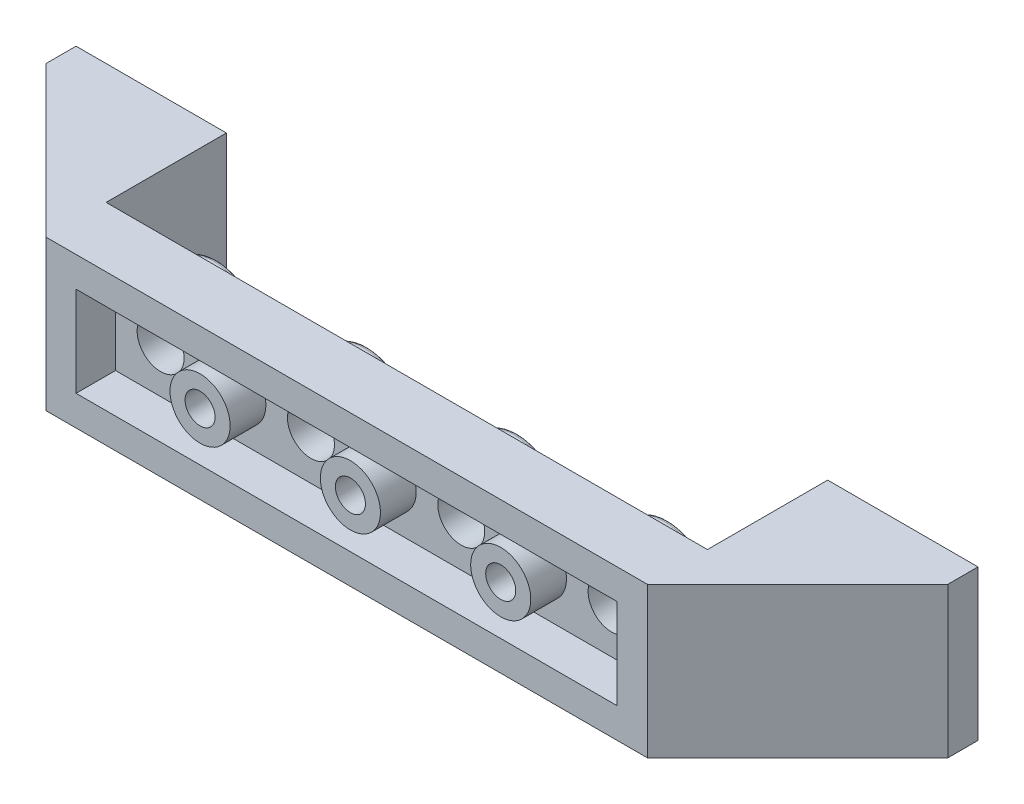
ISO-10303-21;
HEADER;
FILE_DESCRIPTION(('STEP AP214'),'2;1');
FILE_NAME('part.step','',(''),(''),'','','');
FILE_SCHEMA(('AUTOMOTIVE_DESIGN { 1 0 10303 214 1 1 1 1 }'));
ENDSEC;
DATA;
#1=APPLICATION_CONTEXT('core data for automotive mechanical design processes');
#2=APPLICATION_PROTOCOL_DEFINITION('international standard','automotive_design',2000,#1);
#3=PRODUCT_CONTEXT('',#1,'mechanical');
#4=PRODUCT('Part','Part','',(#3));
#5=PRODUCT_RELATED_PRODUCT_CATEGORY('part','',(#4));
#6=PRODUCT_DEFINITION_FORMATION('','',#4);
#7=PRODUCT_DEFINITION_CONTEXT('part definition',#1,'design');
#8=PRODUCT_DEFINITION('design','',#6,#7);
#9=PRODUCT_DEFINITION_SHAPE('','',#8);
#10=(LENGTH_UNIT() NAMED_UNIT(*) SI_UNIT(.MILLI.,.METRE.));
#11=(NAMED_UNIT(*) PLANE_ANGLE_UNIT() SI_UNIT($,.RADIAN.));
#12=(NAMED_UNIT(*) SI_UNIT($,.STERADIAN.) SOLID_ANGLE_UNIT());
#13=UNCERTAINTY_MEASURE_WITH_UNIT(LENGTH_MEASURE(1.E-05),#10,'distance_accuracy_value','');
#14=(GEOMETRIC_REPRESENTATION_CONTEXT(3) GLOBAL_UNCERTAINTY_ASSIGNED_CONTEXT((#13)) GLOBAL_UNIT_ASSIGNED_CONTEXT((#10,
#11,#12)) REPRESENTATION_CONTEXT('',''));
#15=CARTESIAN_POINT('',(0.,0.,0.));
#16=DIRECTION('',(0.,0.,1.));
#17=DIRECTION('',(1.,0.,0.));
#18=AXIS2_PLACEMENT_3D('',#15,#16,#17);
#19=CARTESIAN_POINT('',(-32.,-8.,-6.4));
#20=DIRECTION('',(0.,0.,-1.));
#21=DIRECTION('',(-1.,0.,0.));
#22=AXIS2_PLACEMENT_3D('',#19,#20,#21);
#23=PLANE('',#22);
#24=DIRECTION('',(-1.,0.,0.));
#25=VECTOR('',#24,1.);
#26=CARTESIAN_POINT('',(-32.,0.,-6.4));
#27=LINE('',#26,#25);
#28=CARTESIAN_POINT('',(-32.,0.,-6.4));
#29=VERTEX_POINT('',#28);
#30=CARTESIAN_POINT('',(-40.,0.,-6.4));
#31=VERTEX_POINT('',#30);
#32=EDGE_CURVE('E133',#29,#31,#27,.T.);
#33=ORIENTED_EDGE('',*,*,#32,.F.);
#34=DIRECTION('',(0.,1.,0.));
#35=VECTOR('',#34,1.);
#36=CARTESIAN_POINT('',(-32.,-8.,-6.4));
#37=LINE('',#36,#35);
#38=CARTESIAN_POINT('',(-32.,-8.,-6.4));
#39=VERTEX_POINT('',#38);
#40=EDGE_CURVE('E143',#39,#29,#37,.T.);
#41=ORIENTED_EDGE('',*,*,#40,.F.);
#42=DIRECTION('',(-1.,0.,0.));
#43=VECTOR('',#42,1.);
#44=CARTESIAN_POINT('',(-32.,-8.,-6.4));
#45=LINE('',#44,#43);
#46=CARTESIAN_POINT('',(-40.,-8.00000000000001,-6.4));
#47=VERTEX_POINT('',#46);
#48=EDGE_CURVE('E166',#39,#47,#45,.T.);
#49=ORIENTED_EDGE('',*,*,#48,.T.);
#50=DIRECTION('',(0.,1.,0.));
#51=VECTOR('',#50,1.);
#52=CARTESIAN_POINT('',(-40.,-8.00000000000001,-6.4));
#53=LINE('',#52,#51);
#54=EDGE_CURVE('E150',#47,#31,#53,.T.);
#55=ORIENTED_EDGE('',*,*,#54,.T.);
#56=EDGE_LOOP('',(#33,#41,#49,#55));
#57=FACE_BOUND('',#56,.T.);
#58=CARTESIAN_POINT('',(-36.,-4.,-6.39999999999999));
#59=DIRECTION('',(0.,0.,-1.));
#60=DIRECTION('',(1.,0.,0.));
#61=AXIS2_PLACEMENT_3D('',#58,#59,#60);
#62=CIRCLE('',#61,2.45);
#63=CARTESIAN_POINT('',(-33.55,-4.,-6.39999999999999));
#64=VERTEX_POINT('',#63);
#65=EDGE_CURVE('E374',#64,#64,#62,.T.);
#66=ORIENTED_EDGE('',*,*,#65,.F.);
#67=EDGE_LOOP('',(#66));
#68=FACE_BOUND('',#67,.T.);
#69=ADVANCED_FACE('F26',(#57,#68),#23,.T.);
#70=CARTESIAN_POINT('',(0.,-8.,-6.4));
#71=DIRECTION('',(0.,0.,-1.));
#72=DIRECTION('',(-1.,0.,0.));
#73=AXIS2_PLACEMENT_3D('',#70,#71,#72);
#74=PLANE('',#73);
#75=DIRECTION('',(-1.,0.,0.));
#76=VECTOR('',#75,1.);
#77=CARTESIAN_POINT('',(0.,0.,-6.4));
#78=LINE('',#77,#76);
#79=CARTESIAN_POINT('',(8.,0.,-6.4));
#80=VERTEX_POINT('',#79);
#81=CARTESIAN_POINT('',(0.,0.,-6.4));
#82=VERTEX_POINT('',#81);
#83=EDGE_CURVE('E177',#80,#82,#78,.T.);
#84=ORIENTED_EDGE('',*,*,#83,.F.);
#85=DIRECTION('',(0.,1.,0.));
#86=VECTOR('',#85,1.);
#87=CARTESIAN_POINT('',(8.,-8.,-6.4));
#88=LINE('',#87,#86);
#89=CARTESIAN_POINT('',(8.,-8.,-6.4));
#90=VERTEX_POINT('',#89);
#91=EDGE_CURVE('E871',#90,#80,#88,.T.);
#92=ORIENTED_EDGE('',*,*,#91,.F.);
#93=DIRECTION('',(-1.,0.,0.));
#94=VECTOR('',#93,1.);
#95=CARTESIAN_POINT('',(0.,-8.,-6.4));
#96=LINE('',#95,#94);
#97=CARTESIAN_POINT('',(0.,-8.,-6.4));
#98=VERTEX_POINT('',#97);
#99=EDGE_CURVE('E860',#90,#98,#96,.T.);
#100=ORIENTED_EDGE('',*,*,#99,.T.);
#101=DIRECTION('',(0.,1.,0.));
#102=VECTOR('',#101,1.);
#103=CARTESIAN_POINT('',(0.,-8.,-6.4));
#104=LINE('',#103,#102);
#105=EDGE_CURVE('E198',#98,#82,#104,.T.);
#106=ORIENTED_EDGE('',*,*,#105,.T.);
#107=EDGE_LOOP('',(#84,#92,#100,#106));
#108=FACE_BOUND('',#107,.T.);
#109=CARTESIAN_POINT('',(4.,-4.,-6.4));
#110=DIRECTION('',(0.,0.,-1.));
#111=DIRECTION('',(-1.,0.,0.));
#112=AXIS2_PLACEMENT_3D('',#109,#110,#111);
#113=CIRCLE('',#112,2.45);
#114=CARTESIAN_POINT('',(1.55,-4.,-6.4));
#115=VERTEX_POINT('',#114);
#116=EDGE_CURVE('E363',#115,#115,#113,.T.);
#117=ORIENTED_EDGE('',*,*,#116,.F.);
#118=EDGE_LOOP('',(#117));
#119=FACE_BOUND('',#118,.T.);
#120=ADVANCED_FACE('F399',(#108,#119),#74,.T.);
#121=CARTESIAN_POINT('',(0.,0.,0.));
#122=DIRECTION('',(0.,0.,-1.));
#123=DIRECTION('',(-1.,0.,0.));
#124=AXIS2_PLACEMENT_3D('',#121,#122,#123);
#125=PLANE('',#124);
#126=CARTESIAN_POINT('',(-4.,-4.,0.));
#127=DIRECTION('',(0.,0.,-1.));
#128=DIRECTION('',(-1.,0.,0.));
#129=AXIS2_PLACEMENT_3D('',#126,#127,#128);
#130=CIRCLE('',#129,2.45);
#131=CARTESIAN_POINT('',(-1.55,-4.,0.));
#132=VERTEX_POINT('',#131);
#133=EDGE_CURVE('E246',#132,#132,#130,.T.);
#134=ORIENTED_EDGE('',*,*,#133,.F.);
#135=EDGE_LOOP('',(#134));
#136=FACE_BOUND('',#135,.T.);
#137=DIRECTION('',(0.,1.,0.));
#138=VECTOR('',#137,1.);
#139=CARTESIAN_POINT('',(0.,0.,0.));
#140=LINE('',#139,#138);
#141=CARTESIAN_POINT('',(0.,-8.,0.));
#142=VERTEX_POINT('',#141);
#143=CARTESIAN_POINT('',(0.,0.,0.));
#144=VERTEX_POINT('',#143);
#145=EDGE_CURVE('E283',#142,#144,#140,.T.);
#146=ORIENTED_EDGE('',*,*,#145,.F.);
#147=DIRECTION('',(1.,0.,0.));
#148=VECTOR('',#147,1.);
#149=CARTESIAN_POINT('',(0.,-8.,0.));
#150=LINE('',#149,#148);
#151=CARTESIAN_POINT('',(-32.,-8.,0.));
#152=VERTEX_POINT('',#151);
#153=EDGE_CURVE('E303',#152,#142,#150,.T.);
#154=ORIENTED_EDGE('',*,*,#153,.F.);
#155=DIRECTION('',(0.,-1.,0.));
#156=VECTOR('',#155,1.);
#157=CARTESIAN_POINT('',(-32.,0.,0.));
#158=LINE('',#157,#156);
#159=CARTESIAN_POINT('',(-32.,0.,0.));
#160=VERTEX_POINT('',#159);
#161=EDGE_CURVE('E300',#160,#152,#158,.T.);
#162=ORIENTED_EDGE('',*,*,#161,.F.);
#163=DIRECTION('',(-1.,0.,0.));
#164=VECTOR('',#163,1.);
#165=CARTESIAN_POINT('',(0.,0.,0.));
#166=LINE('',#165,#164);
#167=EDGE_CURVE('E136',#144,#160,#166,.T.);
#168=ORIENTED_EDGE('',*,*,#167,.F.);
#169=EDGE_LOOP('',(#146,#154,#162,#168));
#170=FACE_BOUND('',#169,.T.);
#171=CARTESIAN_POINT('',(-12.,-4.,0.));
#172=DIRECTION('',(0.,0.,-1.));
#173=DIRECTION('',(-1.,0.,0.));
#174=AXIS2_PLACEMENT_3D('',#171,#172,#173);
#175=CIRCLE('',#174,2.45);
#176=CARTESIAN_POINT('',(-9.55,-4.,0.));
#177=VERTEX_POINT('',#176);
#178=EDGE_CURVE('E213',#177,#177,#175,.T.);
#179=ORIENTED_EDGE('',*,*,#178,.F.);
#180=EDGE_LOOP('',(#179));
#181=FACE_BOUND('',#180,.T.);
#182=CARTESIAN_POINT('',(-20.,-4.,0.));
#183=DIRECTION('',(0.,0.,-1.));
#184=DIRECTION('',(-1.,0.,0.));
#185=AXIS2_PLACEMENT_3D('',#182,#183,#184);
#186=CIRCLE('',#185,2.45);
#187=CARTESIAN_POINT('',(-17.55,-4.,0.));
#188=VERTEX_POINT('',#187);
#189=EDGE_CURVE('E328',#188,#188,#186,.T.);
#190=ORIENTED_EDGE('',*,*,#189,.F.);
#191=EDGE_LOOP('',(#190));
#192=FACE_BOUND('',#191,.T.);
#193=CARTESIAN_POINT('',(-28.,-4.,0.));
#194=DIRECTION('',(0.,0.,-1.));
#195=DIRECTION('',(-1.,0.,0.));
#196=AXIS2_PLACEMENT_3D('',#193,#194,#195);
#197=CIRCLE('',#196,2.45);
#198=CARTESIAN_POINT('',(-25.55,-4.,0.));
#199=VERTEX_POINT('',#198);
#200=EDGE_CURVE('E316',#199,#199,#197,.T.);
#201=ORIENTED_EDGE('',*,*,#200,.F.);
#202=EDGE_LOOP('',(#201));
#203=FACE_BOUND('',#202,.T.);
#204=ADVANCED_FACE('F408',(#136,#170,#181,#192,#203),#125,.T.);
#205=CARTESIAN_POINT('',(-1.6,-6.4,1.1));
#206=DIRECTION('',(0.,0.,1.));
#207=DIRECTION('',(1.,0.,0.));
#208=AXIS2_PLACEMENT_3D('',#205,#206,#207);
#209=PLANE('',#208);
#210=CARTESIAN_POINT('',(-28.,-4.00000000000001,1.1));
#211=DIRECTION('',(0.,0.,1.));
#212=DIRECTION('',(1.,0.,0.));
#213=AXIS2_PLACEMENT_3D('',#210,#211,#212);
#214=CIRCLE('',#213,1.25);
#215=CARTESIAN_POINT('',(-26.75,-4.00000000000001,1.1));
#216=VERTEX_POINT('',#215);
#217=EDGE_CURVE('E194',#216,#216,#214,.T.);
#218=ORIENTED_EDGE('',*,*,#217,.F.);
#219=EDGE_LOOP('',(#218));
#220=FACE_BOUND('',#219,.T.);
#221=CARTESIAN_POINT('',(-20.,-4.00000000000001,1.1));
#222=DIRECTION('',(0.,0.,1.));
#223=DIRECTION('',(1.,0.,0.));
#224=AXIS2_PLACEMENT_3D('',#221,#222,#223);
#225=CIRCLE('',#224,1.25);
#226=CARTESIAN_POINT('',(-18.75,-4.00000000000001,1.1));
#227=VERTEX_POINT('',#226);
#228=EDGE_CURVE('E201',#227,#227,#225,.T.);
#229=ORIENTED_EDGE('',*,*,#228,.F.);
#230=EDGE_LOOP('',(#229));
#231=FACE_BOUND('',#230,.T.);
#232=CARTESIAN_POINT('',(-12.,-4.,1.1));
#233=DIRECTION('',(0.,0.,1.));
#234=DIRECTION('',(1.,0.,0.));
#235=AXIS2_PLACEMENT_3D('',#232,#233,#234);
#236=CIRCLE('',#235,1.25);
#237=CARTESIAN_POINT('',(-10.75,-4.,1.1));
#238=VERTEX_POINT('',#237);
#239=EDGE_CURVE('E207',#238,#238,#236,.T.);
#240=ORIENTED_EDGE('',*,*,#239,.F.);
#241=EDGE_LOOP('',(#240));
#242=FACE_BOUND('',#241,.T.);
#243=CARTESIAN_POINT('',(-4.,-4.,1.1));
#244=DIRECTION('',(0.,0.,1.));
#245=DIRECTION('',(1.,0.,0.));
#246=AXIS2_PLACEMENT_3D('',#243,#244,#245);
#247=CIRCLE('',#246,1.25);
#248=CARTESIAN_POINT('',(-2.75,-4.,1.1));
#249=VERTEX_POINT('',#248);
#250=EDGE_CURVE('E240',#249,#249,#247,.T.);
#251=ORIENTED_EDGE('',*,*,#250,.F.);
#252=EDGE_LOOP('',(#251));
#253=FACE_BOUND('',#252,.T.);
#254=DIRECTION('',(0.,1.,0.));
#255=VECTOR('',#254,1.);
#256=CARTESIAN_POINT('',(-1.6,-6.4,1.1));
#257=LINE('',#256,#255);
#258=CARTESIAN_POINT('',(-1.6,-6.4,1.1));
#259=VERTEX_POINT('',#258);
#260=CARTESIAN_POINT('',(-1.6,-1.6,1.1));
#261=VERTEX_POINT('',#260);
#262=EDGE_CURVE('E268',#259,#261,#257,.T.);
#263=ORIENTED_EDGE('',*,*,#262,.T.);
#264=DIRECTION('',(-1.,0.,0.));
#265=VECTOR('',#264,1.);
#266=CARTESIAN_POINT('',(-1.6,-1.6,1.1));
#267=LINE('',#266,#265);
#268=CARTESIAN_POINT('',(-30.4,-1.60000000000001,1.1));
#269=VERTEX_POINT('',#268);
#270=EDGE_CURVE('E271',#261,#269,#267,.T.);
#271=ORIENTED_EDGE('',*,*,#270,.T.);
#272=DIRECTION('',(0.,-1.,0.));
#273=VECTOR('',#272,1.);
#274=CARTESIAN_POINT('',(-30.4,-6.40000000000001,1.1));
#275=LINE('',#274,#273);
#276=CARTESIAN_POINT('',(-30.4,-6.40000000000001,1.1));
#277=VERTEX_POINT('',#276);
#278=EDGE_CURVE('E274',#269,#277,#275,.T.);
#279=ORIENTED_EDGE('',*,*,#278,.T.);
#280=DIRECTION('',(1.,0.,0.));
#281=VECTOR('',#280,1.);
#282=CARTESIAN_POINT('',(-1.6,-6.4,1.1));
#283=LINE('',#282,#281);
#284=EDGE_CURVE('E277',#277,#259,#283,.T.);
#285=ORIENTED_EDGE('',*,*,#284,.T.);
#286=EDGE_LOOP('',(#263,#271,#279,#285));
#287=FACE_BOUND('',#286,.T.);
#288=CARTESIAN_POINT('',(-8.,-4.00000000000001,1.1));
#289=DIRECTION('',(0.,0.,1.));
#290=DIRECTION('',(1.,0.,0.));
#291=AXIS2_PLACEMENT_3D('',#288,#289,#290);
#292=CIRCLE('',#291,1.6);
#293=CARTESIAN_POINT('',(-9.6,-4.00000000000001,1.1));
#294=VERTEX_POINT('',#293);
#295=EDGE_CURVE('E252',#294,#294,#292,.T.);
#296=ORIENTED_EDGE('',*,*,#295,.F.);
#297=EDGE_LOOP('',(#296));
#298=FACE_BOUND('',#297,.T.);
#299=CARTESIAN_POINT('',(-16.,-4.00000000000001,1.1));
#300=DIRECTION('',(0.,0.,1.));
#301=DIRECTION('',(1.,0.,0.));
#302=AXIS2_PLACEMENT_3D('',#299,#300,#301);
#303=CIRCLE('',#302,1.6);
#304=CARTESIAN_POINT('',(-17.6,-4.00000000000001,1.1));
#305=VERTEX_POINT('',#304);
#306=EDGE_CURVE('E234',#305,#305,#303,.T.);
#307=ORIENTED_EDGE('',*,*,#306,.F.);
#308=EDGE_LOOP('',(#307));
#309=FACE_BOUND('',#308,.T.);
#310=CARTESIAN_POINT('',(-24.,-4.00000000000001,1.1));
#311=DIRECTION('',(0.,0.,1.));
#312=DIRECTION('',(1.,0.,0.));
#313=AXIS2_PLACEMENT_3D('',#310,#311,#312);
#314=CIRCLE('',#313,1.6);
#315=CARTESIAN_POINT('',(-25.6,-4.00000000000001,1.1));
#316=VERTEX_POINT('',#315);
#317=EDGE_CURVE('E225',#316,#316,#314,.T.);
#318=ORIENTED_EDGE('',*,*,#317,.F.);
#319=EDGE_LOOP('',(#318));
#320=FACE_BOUND('',#319,.T.);
#321=ADVANCED_FACE('F525',(#220,#231,#242,#253,#287,#298,#309,#320),#209,.T.);
#322=CARTESIAN_POINT('',(0.,0.,3.2));
#323=DIRECTION('',(0.,-1.,0.));
#324=DIRECTION('',(1.,0.,0.));
#325=AXIS2_PLACEMENT_3D('',#322,#323,#324);
#326=PLANE('',#325);
#327=ORIENTED_EDGE('',*,*,#167,.T.);
#328=DIRECTION('',(0.,0.,-1.));
#329=VECTOR('',#328,1.);
#330=CARTESIAN_POINT('',(-32.,0.,0.));
#331=LINE('',#330,#329);
#332=EDGE_CURVE('E128',#160,#29,#331,.T.);
#333=ORIENTED_EDGE('',*,*,#332,.T.);
#334=ORIENTED_EDGE('',*,*,#32,.T.);
#335=DIRECTION('',(0.,0.,1.));
#336=VECTOR('',#335,1.);
#337=CARTESIAN_POINT('',(-40.,0.,-6.4));
#338=LINE('',#337,#336);
#339=CARTESIAN_POINT('',(-40.,0.,-4.79999999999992));
#340=VERTEX_POINT('',#339);
#341=EDGE_CURVE('E154',#31,#340,#338,.T.);
#342=ORIENTED_EDGE('',*,*,#341,.T.);
#343=DIRECTION('',(0.707106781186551,0.,0.707106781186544));
#344=VECTOR('',#343,1.);
#345=CARTESIAN_POINT('',(-40.,0.,-4.79999999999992));
#346=LINE('',#345,#344);
#347=CARTESIAN_POINT('',(-32.,0.,3.2));
#348=VERTEX_POINT('',#347);
#349=EDGE_CURVE('E140',#340,#348,#346,.T.);
#350=ORIENTED_EDGE('',*,*,#349,.T.);
#351=DIRECTION('',(-1.,0.,0.));
#352=VECTOR('',#351,1.);
#353=CARTESIAN_POINT('',(0.,0.,3.2));
#354=LINE('',#353,#352);
#355=CARTESIAN_POINT('',(0.,0.,3.2));
#356=VERTEX_POINT('',#355);
#357=EDGE_CURVE('E349',#356,#348,#354,.T.);
#358=ORIENTED_EDGE('',*,*,#357,.F.);
#359=DIRECTION('',(0.707106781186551,0.,-0.707106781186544));
#360=VECTOR('',#359,1.);
#361=CARTESIAN_POINT('',(8.,0.,-4.79999999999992));
#362=LINE('',#361,#360);
#363=CARTESIAN_POINT('',(8.,0.,-4.79999999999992));
#364=VERTEX_POINT('',#363);
#365=EDGE_CURVE('E170',#356,#364,#362,.T.);
#366=ORIENTED_EDGE('',*,*,#365,.T.);
#367=DIRECTION('',(0.,0.,-1.));
#368=VECTOR('',#367,1.);
#369=CARTESIAN_POINT('',(8.,0.,-6.4));
#370=LINE('',#369,#368);
#371=EDGE_CURVE('E173',#364,#80,#370,.T.);
#372=ORIENTED_EDGE('',*,*,#371,.T.);
#373=ORIENTED_EDGE('',*,*,#83,.T.);
#374=DIRECTION('',(0.,0.,1.));
#375=VECTOR('',#374,1.);
#376=CARTESIAN_POINT('',(0.,0.,0.));
#377=LINE('',#376,#375);
#378=EDGE_CURVE('E180',#82,#144,#377,.T.);
#379=ORIENTED_EDGE('',*,*,#378,.T.);
#380=EDGE_LOOP('',(#327,#333,#334,#342,#350,#358,#366,#372,#373,#379));
#381=FACE_BOUND('',#380,.T.);
#382=ADVANCED_FACE('F130',(#381),#326,.F.);
#383=CARTESIAN_POINT('',(0.,-8.,3.2));
#384=DIRECTION('',(0.,1.,0.));
#385=DIRECTION('',(-1.,0.,0.));
#386=AXIS2_PLACEMENT_3D('',#383,#384,#385);
#387=PLANE('',#386);
#388=ORIENTED_EDGE('',*,*,#153,.T.);
#389=DIRECTION('',(0.,0.,1.));
#390=VECTOR('',#389,1.);
#391=CARTESIAN_POINT('',(0.,-8.,3.2));
#392=LINE('',#391,#390);
#393=EDGE_CURVE('E188',#98,#142,#392,.T.);
#394=ORIENTED_EDGE('',*,*,#393,.F.);
#395=ORIENTED_EDGE('',*,*,#99,.F.);
#396=DIRECTION('',(0.,0.,-1.));
#397=VECTOR('',#396,1.);
#398=CARTESIAN_POINT('',(8.,-8.,-6.4));
#399=LINE('',#398,#397);
#400=CARTESIAN_POINT('',(8.,-8.,-4.79999999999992));
#401=VERTEX_POINT('',#400);
#402=EDGE_CURVE('E867',#401,#90,#399,.T.);
#403=ORIENTED_EDGE('',*,*,#402,.F.);
#404=DIRECTION('',(0.707106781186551,0.,-0.707106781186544));
#405=VECTOR('',#404,1.);
#406=CARTESIAN_POINT('',(8.,-8.,-4.79999999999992));
#407=LINE('',#406,#405);
#408=CARTESIAN_POINT('',(0.,-8.,3.2));
#409=VERTEX_POINT('',#408);
#410=EDGE_CURVE('E193',#409,#401,#407,.T.);
#411=ORIENTED_EDGE('',*,*,#410,.F.);
#412=DIRECTION('',(1.,0.,0.));
#413=VECTOR('',#412,1.);
#414=CARTESIAN_POINT('',(0.,-8.,3.2));
#415=LINE('',#414,#413);
#416=CARTESIAN_POINT('',(-32.,-8.,3.2));
#417=VERTEX_POINT('',#416);
#418=EDGE_CURVE('E49',#417,#409,#415,.T.);
#419=ORIENTED_EDGE('',*,*,#418,.F.);
#420=DIRECTION('',(0.707106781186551,0.,0.707106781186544));
#421=VECTOR('',#420,1.);
#422=CARTESIAN_POINT('',(-40.,-8.00000000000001,-4.79999999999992));
#423=LINE('',#422,#421);
#424=CARTESIAN_POINT('',(-40.,-8.00000000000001,-4.79999999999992));
#425=VERTEX_POINT('',#424);
#426=EDGE_CURVE('E156',#425,#417,#423,.T.);
#427=ORIENTED_EDGE('',*,*,#426,.F.);
#428=DIRECTION('',(0.,0.,1.));
#429=VECTOR('',#428,1.);
#430=CARTESIAN_POINT('',(-40.,-8.00000000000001,-6.4));
#431=LINE('',#430,#429);
#432=EDGE_CURVE('E151',#47,#425,#431,.T.);
#433=ORIENTED_EDGE('',*,*,#432,.F.);
#434=ORIENTED_EDGE('',*,*,#48,.F.);
#435=DIRECTION('',(0.,0.,-1.));
#436=VECTOR('',#435,1.);
#437=CARTESIAN_POINT('',(-32.,-8.,3.2));
#438=LINE('',#437,#436);
#439=EDGE_CURVE('E146',#152,#39,#438,.T.);
#440=ORIENTED_EDGE('',*,*,#439,.F.);
#441=EDGE_LOOP('',(#388,#394,#395,#403,#411,#419,#427,#433,#434,#440));
#442=FACE_BOUND('',#441,.T.);
#443=ADVANCED_FACE('F508',(#442),#387,.F.);
#444=CARTESIAN_POINT('',(0.,0.,3.2));
#445=DIRECTION('',(0.,0.,-1.));
#446=DIRECTION('',(-1.,0.,0.));
#447=AXIS2_PLACEMENT_3D('',#444,#445,#446);
#448=PLANE('',#447);
#449=DIRECTION('',(-1.,0.,0.));
#450=VECTOR('',#449,1.);
#451=CARTESIAN_POINT('',(-1.6,-1.6,3.2));
#452=LINE('',#451,#450);
#453=CARTESIAN_POINT('',(-1.6,-1.6,3.2));
#454=VERTEX_POINT('',#453);
#455=CARTESIAN_POINT('',(-30.4,-1.60000000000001,3.2));
#456=VERTEX_POINT('',#455);
#457=EDGE_CURVE('E259',#454,#456,#452,.T.);
#458=ORIENTED_EDGE('',*,*,#457,.F.);
#459=DIRECTION('',(0.,1.,0.));
#460=VECTOR('',#459,1.);
#461=CARTESIAN_POINT('',(-1.6,-6.4,3.2));
#462=LINE('',#461,#460);
#463=CARTESIAN_POINT('',(-1.6,-6.4,3.2));
#464=VERTEX_POINT('',#463);
#465=EDGE_CURVE('E41',#464,#454,#462,.T.);
#466=ORIENTED_EDGE('',*,*,#465,.F.);
#467=DIRECTION('',(1.,0.,0.));
#468=VECTOR('',#467,1.);
#469=CARTESIAN_POINT('',(-1.6,-6.4,3.2));
#470=LINE('',#469,#468);
#471=CARTESIAN_POINT('',(-30.4,-6.40000000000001,3.2));
#472=VERTEX_POINT('',#471);
#473=EDGE_CURVE('E265',#472,#464,#470,.T.);
#474=ORIENTED_EDGE('',*,*,#473,.F.);
#475=DIRECTION('',(0.,-1.,0.));
#476=VECTOR('',#475,1.);
#477=CARTESIAN_POINT('',(-30.4,-6.40000000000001,3.2));
#478=LINE('',#477,#476);
#479=EDGE_CURVE('E262',#456,#472,#478,.T.);
#480=ORIENTED_EDGE('',*,*,#479,.F.);
#481=EDGE_LOOP('',(#458,#466,#474,#480));
#482=FACE_BOUND('',#481,.T.);
#483=DIRECTION('',(0.,1.,0.));
#484=VECTOR('',#483,1.);
#485=CARTESIAN_POINT('',(0.,0.,3.2));
#486=LINE('',#485,#484);
#487=EDGE_CURVE('E305',#409,#356,#486,.T.);
#488=ORIENTED_EDGE('',*,*,#487,.T.);
#489=ORIENTED_EDGE('',*,*,#357,.T.);
#490=DIRECTION('',(0.,-1.,0.));
#491=VECTOR('',#490,1.);
#492=CARTESIAN_POINT('',(-32.,0.,3.2));
#493=LINE('',#492,#491);
#494=EDGE_CURVE('E347',#348,#417,#493,.T.);
#495=ORIENTED_EDGE('',*,*,#494,.T.);
#496=ORIENTED_EDGE('',*,*,#418,.T.);
#497=EDGE_LOOP('',(#488,#489,#495,#496));
#498=FACE_BOUND('',#497,.T.);
#499=ADVANCED_FACE('F351',(#482,#498),#448,.F.);
#500=CARTESIAN_POINT('',(-1.6,-6.4,1.1));
#501=DIRECTION('',(1.,0.,0.));
#502=DIRECTION('',(0.,0.,-1.));
#503=AXIS2_PLACEMENT_3D('',#500,#501,#502);
#504=PLANE('',#503);
#505=ORIENTED_EDGE('',*,*,#465,.T.);
#506=DIRECTION('',(0.,0.,1.));
#507=VECTOR('',#506,1.);
#508=CARTESIAN_POINT('',(-1.6,-1.6,1.1));
#509=LINE('',#508,#507);
#510=EDGE_CURVE('E280',#261,#454,#509,.T.);
#511=ORIENTED_EDGE('',*,*,#510,.F.);
#512=ORIENTED_EDGE('',*,*,#262,.F.);
#513=DIRECTION('',(0.,0.,1.));
#514=VECTOR('',#513,1.);
#515=CARTESIAN_POINT('',(-1.6,-6.4,1.1));
#516=LINE('',#515,#514);
#517=EDGE_CURVE('E281',#259,#464,#516,.T.);
#518=ORIENTED_EDGE('',*,*,#517,.T.);
#519=EDGE_LOOP('',(#505,#511,#512,#518));
#520=FACE_BOUND('',#519,.T.);
#521=ADVANCED_FACE('F507',(#520),#504,.F.);
#522=CARTESIAN_POINT('',(-1.6,-6.4,1.1));
#523=DIRECTION('',(0.,-1.,0.));
#524=DIRECTION('',(1.,0.,0.));
#525=AXIS2_PLACEMENT_3D('',#522,#523,#524);
#526=PLANE('',#525);
#527=ORIENTED_EDGE('',*,*,#473,.T.);
#528=ORIENTED_EDGE('',*,*,#517,.F.);
#529=ORIENTED_EDGE('',*,*,#284,.F.);
#530=DIRECTION('',(0.,0.,1.));
#531=VECTOR('',#530,1.);
#532=CARTESIAN_POINT('',(-30.4,-6.40000000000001,1.1));
#533=LINE('',#532,#531);
#534=EDGE_CURVE('E284',#277,#472,#533,.T.);
#535=ORIENTED_EDGE('',*,*,#534,.T.);
#536=EDGE_LOOP('',(#527,#528,#529,#535));
#537=FACE_BOUND('',#536,.T.);
#538=ADVANCED_FACE('F803',(#537),#526,.F.);
#539=CARTESIAN_POINT('',(-30.4,-6.40000000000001,1.1));
#540=DIRECTION('',(-1.,0.,0.));
#541=DIRECTION('',(0.,0.,1.));
#542=AXIS2_PLACEMENT_3D('',#539,#540,#541);
#543=PLANE('',#542);
#544=ORIENTED_EDGE('',*,*,#479,.T.);
#545=ORIENTED_EDGE('',*,*,#534,.F.);
#546=ORIENTED_EDGE('',*,*,#278,.F.);
#547=DIRECTION('',(0.,0.,1.));
#548=VECTOR('',#547,1.);
#549=CARTESIAN_POINT('',(-30.4,-1.60000000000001,1.1));
#550=LINE('',#549,#548);
#551=EDGE_CURVE('E286',#269,#456,#550,.T.);
#552=ORIENTED_EDGE('',*,*,#551,.T.);
#553=EDGE_LOOP('',(#544,#545,#546,#552));
#554=FACE_BOUND('',#553,.T.);
#555=ADVANCED_FACE('F795',(#554),#543,.F.);
#556=CARTESIAN_POINT('',(-1.6,-1.6,1.1));
#557=DIRECTION('',(0.,1.,0.));
#558=DIRECTION('',(-1.,0.,0.));
#559=AXIS2_PLACEMENT_3D('',#556,#557,#558);
#560=PLANE('',#559);
#561=ORIENTED_EDGE('',*,*,#457,.T.);
#562=ORIENTED_EDGE('',*,*,#551,.F.);
#563=ORIENTED_EDGE('',*,*,#270,.F.);
#564=ORIENTED_EDGE('',*,*,#510,.T.);
#565=EDGE_LOOP('',(#561,#562,#563,#564));
#566=FACE_BOUND('',#565,.T.);
#567=ADVANCED_FACE('F788',(#566),#560,.F.);
#568=CARTESIAN_POINT('',(-8.,-4.00000000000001,3.));
#569=DIRECTION('',(0.,0.,1.));
#570=DIRECTION('',(1.,0.,0.));
#571=AXIS2_PLACEMENT_3D('',#568,#569,#570);
#572=PLANE('',#571);
#573=CARTESIAN_POINT('',(-8.,-4.00000000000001,3.));
#574=DIRECTION('',(0.,0.,1.));
#575=DIRECTION('',(1.,0.,0.));
#576=AXIS2_PLACEMENT_3D('',#573,#574,#575);
#577=CIRCLE('',#576,1.6);
#578=CARTESIAN_POINT('',(-9.6,-4.00000000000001,3.));
#579=VERTEX_POINT('',#578);
#580=EDGE_CURVE('E255',#579,#579,#577,.T.);
#581=ORIENTED_EDGE('',*,*,#580,.T.);
#582=EDGE_LOOP('',(#581));
#583=FACE_BOUND('',#582,.T.);
#584=CARTESIAN_POINT('',(-8.,-4.00000000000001,3.));
#585=DIRECTION('',(0.,0.,1.));
#586=DIRECTION('',(1.,0.,0.));
#587=AXIS2_PLACEMENT_3D('',#584,#585,#586);
#588=CIRCLE('',#587,0.799999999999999);
#589=CARTESIAN_POINT('',(-8.8,-4.00000000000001,3.));
#590=VERTEX_POINT('',#589);
#591=EDGE_CURVE('E249',#590,#590,#588,.T.);
#592=ORIENTED_EDGE('',*,*,#591,.F.);
#593=EDGE_LOOP('',(#592));
#594=FACE_BOUND('',#593,.T.);
#595=ADVANCED_FACE('F781',(#583,#594),#572,.T.);
#596=CARTESIAN_POINT('',(-8.,-4.00000000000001,3.));
#597=DIRECTION('',(0.,0.,-1.));
#598=DIRECTION('',(-1.,0.,0.));
#599=AXIS2_PLACEMENT_3D('',#596,#597,#598);
#600=CYLINDRICAL_SURFACE('',#599,1.6);
#601=CARTESIAN_POINT('',(-9.6,-4.00000000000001,3.));
#602=CARTESIAN_POINT('',(-9.6,-4.00000000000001,2.98020833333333));
#603=CARTESIAN_POINT('',(-9.6,-4.00000000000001,2.96041666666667));
#604=CARTESIAN_POINT('',(-9.6,-4.00000000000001,2.92083333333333));
#605=CARTESIAN_POINT('',(-9.6,-4.00000000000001,2.90104166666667));
#606=CARTESIAN_POINT('',(-9.6,-4.00000000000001,2.86145833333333));
#607=CARTESIAN_POINT('',(-9.6,-4.00000000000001,2.84166666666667));
#608=CARTESIAN_POINT('',(-9.6,-4.00000000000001,2.80208333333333));
#609=CARTESIAN_POINT('',(-9.6,-4.00000000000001,2.78229166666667));
#610=CARTESIAN_POINT('',(-9.6,-4.00000000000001,2.74270833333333));
#611=CARTESIAN_POINT('',(-9.6,-4.00000000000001,2.72291666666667));
#612=CARTESIAN_POINT('',(-9.6,-4.00000000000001,2.68333333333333));
#613=CARTESIAN_POINT('',(-9.6,-4.00000000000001,2.66354166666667));
#614=CARTESIAN_POINT('',(-9.6,-4.00000000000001,2.62395833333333));
#615=CARTESIAN_POINT('',(-9.6,-4.00000000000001,2.60416666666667));
#616=CARTESIAN_POINT('',(-9.6,-4.00000000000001,2.56458333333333));
#617=CARTESIAN_POINT('',(-9.6,-4.00000000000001,2.54479166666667));
#618=CARTESIAN_POINT('',(-9.6,-4.00000000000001,2.50520833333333));
#619=CARTESIAN_POINT('',(-9.6,-4.00000000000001,2.48541666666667));
#620=CARTESIAN_POINT('',(-9.6,-4.00000000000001,2.44583333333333));
#621=CARTESIAN_POINT('',(-9.6,-4.00000000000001,2.42604166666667));
#622=CARTESIAN_POINT('',(-9.6,-4.00000000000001,2.38645833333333));
#623=CARTESIAN_POINT('',(-9.6,-4.00000000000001,2.36666666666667));
#624=CARTESIAN_POINT('',(-9.6,-4.00000000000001,2.32708333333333));
#625=CARTESIAN_POINT('',(-9.6,-4.00000000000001,2.30729166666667));
#626=CARTESIAN_POINT('',(-9.6,-4.00000000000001,2.26770833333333));
#627=CARTESIAN_POINT('',(-9.6,-4.00000000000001,2.24791666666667));
#628=CARTESIAN_POINT('',(-9.6,-4.00000000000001,2.20833333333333));
#629=CARTESIAN_POINT('',(-9.6,-4.00000000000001,2.18854166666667));
#630=CARTESIAN_POINT('',(-9.6,-4.00000000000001,2.14895833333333));
#631=CARTESIAN_POINT('',(-9.6,-4.00000000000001,2.12916666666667));
#632=CARTESIAN_POINT('',(-9.6,-4.00000000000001,2.08958333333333));
#633=CARTESIAN_POINT('',(-9.6,-4.00000000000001,2.06979166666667));
#634=CARTESIAN_POINT('',(-9.6,-4.00000000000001,2.03020833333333));
#635=CARTESIAN_POINT('',(-9.6,-4.00000000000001,2.01041666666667));
#636=CARTESIAN_POINT('',(-9.6,-4.00000000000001,1.97083333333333));
#637=CARTESIAN_POINT('',(-9.6,-4.00000000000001,1.95104166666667));
#638=CARTESIAN_POINT('',(-9.6,-4.00000000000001,1.91145833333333));
#639=CARTESIAN_POINT('',(-9.6,-4.00000000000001,1.89166666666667));
#640=CARTESIAN_POINT('',(-9.6,-4.00000000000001,1.85208333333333));
#641=CARTESIAN_POINT('',(-9.6,-4.00000000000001,1.83229166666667));
#642=CARTESIAN_POINT('',(-9.6,-4.00000000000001,1.79270833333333));
#643=CARTESIAN_POINT('',(-9.6,-4.00000000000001,1.77291666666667));
#644=CARTESIAN_POINT('',(-9.6,-4.00000000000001,1.73333333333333));
#645=CARTESIAN_POINT('',(-9.6,-4.00000000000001,1.71354166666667));
#646=CARTESIAN_POINT('',(-9.6,-4.00000000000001,1.67395833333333));
#647=CARTESIAN_POINT('',(-9.6,-4.00000000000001,1.65416666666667));
#648=CARTESIAN_POINT('',(-9.6,-4.00000000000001,1.61458333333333));
#649=CARTESIAN_POINT('',(-9.6,-4.00000000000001,1.59479166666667));
#650=CARTESIAN_POINT('',(-9.6,-4.00000000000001,1.55520833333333));
#651=CARTESIAN_POINT('',(-9.6,-4.00000000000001,1.53541666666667));
#652=CARTESIAN_POINT('',(-9.6,-4.00000000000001,1.49583333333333));
#653=CARTESIAN_POINT('',(-9.6,-4.00000000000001,1.47604166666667));
#654=CARTESIAN_POINT('',(-9.6,-4.00000000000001,1.43645833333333));
#655=CARTESIAN_POINT('',(-9.6,-4.00000000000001,1.41666666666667));
#656=CARTESIAN_POINT('',(-9.6,-4.00000000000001,1.37708333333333));
#657=CARTESIAN_POINT('',(-9.6,-4.00000000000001,1.35729166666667));
#658=CARTESIAN_POINT('',(-9.6,-4.00000000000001,1.31770833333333));
#659=CARTESIAN_POINT('',(-9.6,-4.00000000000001,1.29791666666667));
#660=CARTESIAN_POINT('',(-9.6,-4.00000000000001,1.25833333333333));
#661=CARTESIAN_POINT('',(-9.6,-4.00000000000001,1.23854166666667));
#662=CARTESIAN_POINT('',(-9.6,-4.00000000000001,1.19895833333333));
#663=CARTESIAN_POINT('',(-9.6,-4.00000000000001,1.17916666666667));
#664=CARTESIAN_POINT('',(-9.6,-4.00000000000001,1.13958333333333));
#665=CARTESIAN_POINT('',(-9.6,-4.00000000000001,1.11979166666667));
#666=CARTESIAN_POINT('',(-9.6,-4.00000000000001,1.1));
#667=B_SPLINE_CURVE_WITH_KNOTS('',3,(#601,#602,#603,#604,#605,#606,#607,#608,#609,#610,#611,
#612,#613,#614,#615,#616,#617,#618,#619,#620,#621,#622,#623,#624,#625,#626,#627,#628,#629,#630,
#631,#632,#633,#634,#635,#636,#637,#638,#639,#640,#641,#642,#643,#644,#645,#646,#647,#648,#649,
#650,#651,#652,#653,#654,#655,#656,#657,#658,#659,#660,#661,#662,#663,#664,#665,#666),
.UNSPECIFIED.,.F.,.F.,(4,2,2,2,2,2,2,2,2,2,2,2,2,2,2,2,2,2,2,2,2,2,2,2,2,2,2,2,2,2,2,2,4),(0.,
0.0593750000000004,0.11875,0.178125,0.2375,0.296875,0.35625,0.415625,0.475,0.534375,0.59375,
0.653125,0.7125,0.771875,0.83125,0.890625,0.95,1.009375,1.06875,1.128125,1.1875,1.246875,
1.30625,1.365625,1.425,1.484375,1.54375,1.603125,1.6625,1.721875,1.78125,1.840625,1.9),.UNSPECIFIED.);
#668=EDGE_CURVE('BSEAM773',#579,#294,#667,.T.);
#669=ORIENTED_EDGE('',*,*,#580,.F.);
#670=ORIENTED_EDGE('',*,*,#295,.T.);
#671=ORIENTED_EDGE('',*,*,#668,.T.);
#672=ORIENTED_EDGE('',*,*,#668,.F.);
#673=EDGE_LOOP('',(#669,#671,#670,#672));
#674=FACE_BOUND('',#673,.T.);
#675=ADVANCED_FACE('F773',(#674),#600,.T.);
#676=CARTESIAN_POINT('',(-8.,-4.00000000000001,3.));
#677=DIRECTION('',(0.,0.,-1.));
#678=DIRECTION('',(-1.,0.,0.));
#679=AXIS2_PLACEMENT_3D('',#676,#677,#678);
#680=CYLINDRICAL_SURFACE('',#679,0.799999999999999);
#681=CARTESIAN_POINT('',(-8.,-4.00000000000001,1.1));
#682=DIRECTION('',(0.,0.,1.));
#683=DIRECTION('',(1.,0.,0.));
#684=AXIS2_PLACEMENT_3D('',#681,#682,#683);
#685=CIRCLE('',#684,0.799999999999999);
#686=CARTESIAN_POINT('',(-8.8,-4.00000000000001,1.1));
#687=VERTEX_POINT('',#686);
#688=EDGE_CURVE('E343',#687,#687,#685,.F.);
#689=CARTESIAN_POINT('',(-8.8,-4.00000000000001,3.));
#690=CARTESIAN_POINT('',(-8.8,-4.00000000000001,2.98020833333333));
#691=CARTESIAN_POINT('',(-8.8,-4.00000000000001,2.96041666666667));
#692=CARTESIAN_POINT('',(-8.8,-4.00000000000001,2.92083333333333));
#693=CARTESIAN_POINT('',(-8.8,-4.00000000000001,2.90104166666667));
#694=CARTESIAN_POINT('',(-8.8,-4.00000000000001,2.86145833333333));
#695=CARTESIAN_POINT('',(-8.8,-4.00000000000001,2.84166666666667));
#696=CARTESIAN_POINT('',(-8.8,-4.00000000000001,2.80208333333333));
#697=CARTESIAN_POINT('',(-8.8,-4.00000000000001,2.78229166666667));
#698=CARTESIAN_POINT('',(-8.8,-4.00000000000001,2.74270833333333));
#699=CARTESIAN_POINT('',(-8.8,-4.00000000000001,2.72291666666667));
#700=CARTESIAN_POINT('',(-8.8,-4.00000000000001,2.68333333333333));
#701=CARTESIAN_POINT('',(-8.8,-4.00000000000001,2.66354166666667));
#702=CARTESIAN_POINT('',(-8.8,-4.00000000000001,2.62395833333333));
#703=CARTESIAN_POINT('',(-8.8,-4.00000000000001,2.60416666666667));
#704=CARTESIAN_POINT('',(-8.8,-4.00000000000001,2.56458333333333));
#705=CARTESIAN_POINT('',(-8.8,-4.00000000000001,2.54479166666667));
#706=CARTESIAN_POINT('',(-8.8,-4.00000000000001,2.50520833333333));
#707=CARTESIAN_POINT('',(-8.8,-4.00000000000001,2.48541666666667));
#708=CARTESIAN_POINT('',(-8.8,-4.00000000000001,2.44583333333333));
#709=CARTESIAN_POINT('',(-8.8,-4.00000000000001,2.42604166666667));
#710=CARTESIAN_POINT('',(-8.8,-4.00000000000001,2.38645833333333));
#711=CARTESIAN_POINT('',(-8.8,-4.00000000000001,2.36666666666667));
#712=CARTESIAN_POINT('',(-8.8,-4.00000000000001,2.32708333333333));
#713=CARTESIAN_POINT('',(-8.8,-4.00000000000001,2.30729166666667));
#714=CARTESIAN_POINT('',(-8.8,-4.00000000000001,2.26770833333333));
#715=CARTESIAN_POINT('',(-8.8,-4.00000000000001,2.24791666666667));
#716=CARTESIAN_POINT('',(-8.8,-4.00000000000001,2.20833333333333));
#717=CARTESIAN_POINT('',(-8.8,-4.00000000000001,2.18854166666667));
#718=CARTESIAN_POINT('',(-8.8,-4.00000000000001,2.14895833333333));
#719=CARTESIAN_POINT('',(-8.8,-4.00000000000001,2.12916666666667));
#720=CARTESIAN_POINT('',(-8.8,-4.00000000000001,2.08958333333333));
#721=CARTESIAN_POINT('',(-8.8,-4.00000000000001,2.06979166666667));
#722=CARTESIAN_POINT('',(-8.8,-4.00000000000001,2.03020833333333));
#723=CARTESIAN_POINT('',(-8.8,-4.00000000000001,2.01041666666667));
#724=CARTESIAN_POINT('',(-8.8,-4.00000000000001,1.97083333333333));
#725=CARTESIAN_POINT('',(-8.8,-4.00000000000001,1.95104166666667));
#726=CARTESIAN_POINT('',(-8.8,-4.00000000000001,1.91145833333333));
#727=CARTESIAN_POINT('',(-8.8,-4.00000000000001,1.89166666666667));
#728=CARTESIAN_POINT('',(-8.8,-4.00000000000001,1.85208333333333));
#729=CARTESIAN_POINT('',(-8.8,-4.00000000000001,1.83229166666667));
#730=CARTESIAN_POINT('',(-8.8,-4.00000000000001,1.79270833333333));
#731=CARTESIAN_POINT('',(-8.8,-4.00000000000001,1.77291666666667));
#732=CARTESIAN_POINT('',(-8.8,-4.00000000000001,1.73333333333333));
#733=CARTESIAN_POINT('',(-8.8,-4.00000000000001,1.71354166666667));
#734=CARTESIAN_POINT('',(-8.8,-4.00000000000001,1.67395833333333));
#735=CARTESIAN_POINT('',(-8.8,-4.00000000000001,1.65416666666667));
#736=CARTESIAN_POINT('',(-8.8,-4.00000000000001,1.61458333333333));
#737=CARTESIAN_POINT('',(-8.8,-4.00000000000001,1.59479166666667));
#738=CARTESIAN_POINT('',(-8.8,-4.00000000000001,1.55520833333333));
#739=CARTESIAN_POINT('',(-8.8,-4.00000000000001,1.53541666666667));
#740=CARTESIAN_POINT('',(-8.8,-4.00000000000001,1.49583333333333));
#741=CARTESIAN_POINT('',(-8.8,-4.00000000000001,1.47604166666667));
#742=CARTESIAN_POINT('',(-8.8,-4.00000000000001,1.43645833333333));
#743=CARTESIAN_POINT('',(-8.8,-4.00000000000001,1.41666666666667));
#744=CARTESIAN_POINT('',(-8.8,-4.00000000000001,1.37708333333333));
#745=CARTESIAN_POINT('',(-8.8,-4.00000000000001,1.35729166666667));
#746=CARTESIAN_POINT('',(-8.8,-4.00000000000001,1.31770833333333));
#747=CARTESIAN_POINT('',(-8.8,-4.00000000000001,1.29791666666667));
#748=CARTESIAN_POINT('',(-8.8,-4.00000000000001,1.25833333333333));
#749=CARTESIAN_POINT('',(-8.8,-4.00000000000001,1.23854166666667));
#750=CARTESIAN_POINT('',(-8.8,-4.00000000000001,1.19895833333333));
#751=CARTESIAN_POINT('',(-8.8,-4.00000000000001,1.17916666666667));
#752=CARTESIAN_POINT('',(-8.8,-4.00000000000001,1.13958333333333));
#753=CARTESIAN_POINT('',(-8.8,-4.00000000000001,1.11979166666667));
#754=CARTESIAN_POINT('',(-8.8,-4.00000000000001,1.1));
#755=B_SPLINE_CURVE_WITH_KNOTS('',3,(#689,#690,#691,#692,#693,#694,#695,#696,#697,#698,#699,
#700,#701,#702,#703,#704,#705,#706,#707,#708,#709,#710,#711,#712,#713,#714,#715,#716,#717,#718,
#719,#720,#721,#722,#723,#724,#725,#726,#727,#728,#729,#730,#731,#732,#733,#734,#735,#736,#737,
#738,#739,#740,#741,#742,#743,#744,#745,#746,#747,#748,#749,#750,#751,#752,#753,#754),
.UNSPECIFIED.,.F.,.F.,(4,2,2,2,2,2,2,2,2,2,2,2,2,2,2,2,2,2,2,2,2,2,2,2,2,2,2,2,2,2,2,2,4),(0.,
0.0593750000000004,0.11875,0.178125,0.2375,0.296875,0.35625,0.415625,0.475,0.534375,0.59375,
0.653125,0.7125,0.771875,0.83125,0.890625,0.95,1.009375,1.06875,1.128125,1.1875,1.246875,
1.30625,1.365625,1.425,1.484375,1.54375,1.603125,1.6625,1.721875,1.78125,1.840625,1.9),.UNSPECIFIED.);
#756=EDGE_CURVE('BSEAM766',#590,#687,#755,.T.);
#757=ORIENTED_EDGE('',*,*,#591,.T.);
#758=ORIENTED_EDGE('',*,*,#688,.T.);
#759=ORIENTED_EDGE('',*,*,#756,.T.);
#760=ORIENTED_EDGE('',*,*,#756,.F.);
#761=EDGE_LOOP('',(#757,#759,#758,#760));
#762=FACE_BOUND('',#761,.T.);
#763=ADVANCED_FACE('F766',(#762),#680,.F.);
#764=ORIENTED_EDGE('',*,*,#688,.F.);
#765=EDGE_LOOP('',(#764));
#766=FACE_BOUND('',#765,.T.);
#767=ADVANCED_FACE('F658',(#766),#209,.T.);
#768=CARTESIAN_POINT('',(-4.,-4.,-1.9));
#769=DIRECTION('',(0.,0.,1.));
#770=DIRECTION('',(1.,0.,0.));
#771=AXIS2_PLACEMENT_3D('',#768,#769,#770);
#772=CYLINDRICAL_SURFACE('',#771,2.45);
#773=CARTESIAN_POINT('',(-4.,-4.,-1.7));
#774=DIRECTION('',(0.,0.,-1.));
#775=DIRECTION('',(-1.,0.,0.));
#776=AXIS2_PLACEMENT_3D('',#773,#774,#775);
#777=CIRCLE('',#776,2.45);
#778=CARTESIAN_POINT('',(-1.55,-4.,-1.7));
#779=VERTEX_POINT('',#778);
#780=EDGE_CURVE('E337',#779,#779,#777,.F.);
#781=CARTESIAN_POINT('',(-1.55,-4.,-1.7));
#782=CARTESIAN_POINT('',(-1.55,-4.,-1.68229166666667));
#783=CARTESIAN_POINT('',(-1.55,-4.,-1.66458333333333));
#784=CARTESIAN_POINT('',(-1.55,-4.,-1.62916666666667));
#785=CARTESIAN_POINT('',(-1.55,-4.,-1.61145833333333));
#786=CARTESIAN_POINT('',(-1.55,-4.,-1.57604166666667));
#787=CARTESIAN_POINT('',(-1.55,-4.,-1.55833333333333));
#788=CARTESIAN_POINT('',(-1.55,-4.,-1.52291666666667));
#789=CARTESIAN_POINT('',(-1.55,-4.,-1.50520833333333));
#790=CARTESIAN_POINT('',(-1.55,-4.,-1.46979166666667));
#791=CARTESIAN_POINT('',(-1.55,-4.,-1.45208333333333));
#792=CARTESIAN_POINT('',(-1.55,-4.,-1.41666666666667));
#793=CARTESIAN_POINT('',(-1.55,-4.,-1.39895833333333));
#794=CARTESIAN_POINT('',(-1.55,-4.,-1.36354166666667));
#795=CARTESIAN_POINT('',(-1.55,-4.,-1.34583333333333));
#796=CARTESIAN_POINT('',(-1.55,-4.,-1.31041666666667));
#797=CARTESIAN_POINT('',(-1.55,-4.,-1.29270833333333));
#798=CARTESIAN_POINT('',(-1.55,-4.,-1.25729166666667));
#799=CARTESIAN_POINT('',(-1.55,-4.,-1.23958333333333));
#800=CARTESIAN_POINT('',(-1.55,-4.,-1.20416666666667));
#801=CARTESIAN_POINT('',(-1.55,-4.,-1.18645833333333));
#802=CARTESIAN_POINT('',(-1.55,-4.,-1.15104166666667));
#803=CARTESIAN_POINT('',(-1.55,-4.,-1.13333333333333));
#804=CARTESIAN_POINT('',(-1.55,-4.,-1.09791666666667));
#805=CARTESIAN_POINT('',(-1.55,-4.,-1.08020833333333));
#806=CARTESIAN_POINT('',(-1.55,-4.,-1.04479166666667));
#807=CARTESIAN_POINT('',(-1.55,-4.,-1.02708333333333));
#808=CARTESIAN_POINT('',(-1.55,-4.,-0.991666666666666));
#809=CARTESIAN_POINT('',(-1.55,-4.,-0.973958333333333));
#810=CARTESIAN_POINT('',(-1.55,-4.,-0.938541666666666));
#811=CARTESIAN_POINT('',(-1.55,-4.,-0.920833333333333));
#812=CARTESIAN_POINT('',(-1.55,-4.,-0.885416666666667));
#813=CARTESIAN_POINT('',(-1.55,-4.,-0.867708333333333));
#814=CARTESIAN_POINT('',(-1.55,-4.,-0.832291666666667));
#815=CARTESIAN_POINT('',(-1.55,-4.,-0.814583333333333));
#816=CARTESIAN_POINT('',(-1.55,-4.,-0.779166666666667));
#817=CARTESIAN_POINT('',(-1.55,-4.,-0.761458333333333));
#818=CARTESIAN_POINT('',(-1.55,-4.,-0.726041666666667));
#819=CARTESIAN_POINT('',(-1.55,-4.,-0.708333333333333));
#820=CARTESIAN_POINT('',(-1.55,-4.,-0.672916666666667));
#821=CARTESIAN_POINT('',(-1.55,-4.,-0.655208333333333));
#822=CARTESIAN_POINT('',(-1.55,-4.,-0.619791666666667));
#823=CARTESIAN_POINT('',(-1.55,-4.,-0.602083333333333));
#824=CARTESIAN_POINT('',(-1.55,-4.,-0.566666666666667));
#825=CARTESIAN_POINT('',(-1.55,-4.,-0.548958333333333));
#826=CARTESIAN_POINT('',(-1.55,-4.,-0.513541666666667));
#827=CARTESIAN_POINT('',(-1.55,-4.,-0.495833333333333));
#828=CARTESIAN_POINT('',(-1.55,-4.,-0.460416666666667));
#829=CARTESIAN_POINT('',(-1.55,-4.,-0.442708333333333));
#830=CARTESIAN_POINT('',(-1.55,-4.,-0.407291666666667));
#831=CARTESIAN_POINT('',(-1.55,-4.,-0.389583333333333));
#832=CARTESIAN_POINT('',(-1.55,-4.,-0.354166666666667));
#833=CARTESIAN_POINT('',(-1.55,-4.,-0.336458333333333));
#834=CARTESIAN_POINT('',(-1.55,-4.,-0.301041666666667));
#835=CARTESIAN_POINT('',(-1.55,-4.,-0.283333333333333));
#836=CARTESIAN_POINT('',(-1.55,-4.,-0.247916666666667));
#837=CARTESIAN_POINT('',(-1.55,-4.,-0.230208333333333));
#838=CARTESIAN_POINT('',(-1.55,-4.,-0.194791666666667));
#839=CARTESIAN_POINT('',(-1.55,-4.,-0.177083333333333));
#840=CARTESIAN_POINT('',(-1.55,-4.,-0.141666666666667));
#841=CARTESIAN_POINT('',(-1.55,-4.,-0.123958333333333));
#842=CARTESIAN_POINT('',(-1.55,-4.,-0.0885416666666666));
#843=CARTESIAN_POINT('',(-1.55,-4.,-0.0708333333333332));
#844=CARTESIAN_POINT('',(-1.55,-4.,-0.0354166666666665));
#845=CARTESIAN_POINT('',(-1.55,-4.,-0.0177083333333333));
#846=CARTESIAN_POINT('',(-1.55,-4.,0.));
#847=B_SPLINE_CURVE_WITH_KNOTS('',3,(#781,#782,#783,#784,#785,#786,#787,#788,#789,#790,#791,
#792,#793,#794,#795,#796,#797,#798,#799,#800,#801,#802,#803,#804,#805,#806,#807,#808,#809,#810,
#811,#812,#813,#814,#815,#816,#817,#818,#819,#820,#821,#822,#823,#824,#825,#826,#827,#828,#829,
#830,#831,#832,#833,#834,#835,#836,#837,#838,#839,#840,#841,#842,#843,#844,#845,#846),
.UNSPECIFIED.,.F.,.F.,(4,2,2,2,2,2,2,2,2,2,2,2,2,2,2,2,2,2,2,2,2,2,2,2,2,2,2,2,2,2,2,2,4),(0.,
0.053125,0.10625,0.159375,0.2125,0.265625,0.31875,0.371875,0.425,0.478125,0.53125,0.584375,
0.6375,0.690625,0.74375,0.796875,0.85,0.903125,0.95625,1.009375,1.0625,1.115625,1.16875,
1.221875,1.275,1.328125,1.38125,1.434375,1.4875,1.540625,1.59375,1.646875,1.7),.UNSPECIFIED.);
#848=EDGE_CURVE('BSEAM751',#779,#132,#847,.T.);
#849=ORIENTED_EDGE('',*,*,#780,.T.);
#850=ORIENTED_EDGE('',*,*,#133,.T.);
#851=ORIENTED_EDGE('',*,*,#848,.T.);
#852=ORIENTED_EDGE('',*,*,#848,.F.);
#853=EDGE_LOOP('',(#849,#851,#850,#852));
#854=FACE_BOUND('',#853,.T.);
#855=ADVANCED_FACE('F751',(#854),#772,.T.);
#856=CARTESIAN_POINT('',(-4.,-4.,-1.9));
#857=DIRECTION('',(0.,0.,-1.));
#858=DIRECTION('',(-1.,0.,0.));
#859=AXIS2_PLACEMENT_3D('',#856,#857,#858);
#860=PLANE('',#859);
#861=CARTESIAN_POINT('',(-4.,-4.,-1.9));
#862=DIRECTION('',(0.,0.,-1.));
#863=DIRECTION('',(-1.,0.,0.));
#864=AXIS2_PLACEMENT_3D('',#861,#862,#863);
#865=CIRCLE('',#864,2.25);
#866=CARTESIAN_POINT('',(-6.25,-4.,-1.9));
#867=VERTEX_POINT('',#866);
#868=EDGE_CURVE('E340',#867,#867,#865,.T.);
#869=ORIENTED_EDGE('',*,*,#868,.T.);
#870=EDGE_LOOP('',(#869));
#871=FACE_BOUND('',#870,.T.);
#872=ADVANCED_FACE('F743',(#871),#860,.T.);
#873=CARTESIAN_POINT('',(-4.,-4.,-1.7));
#874=DIRECTION('',(0.,0.,-1.));
#875=DIRECTION('',(-1.,0.,0.));
#876=AXIS2_PLACEMENT_3D('',#873,#874,#875);
#877=TOROIDAL_SURFACE('',#876,2.25,0.2);
#878=ORIENTED_EDGE('',*,*,#780,.F.);
#879=EDGE_LOOP('',(#878));
#880=FACE_BOUND('',#879,.T.);
#881=ORIENTED_EDGE('',*,*,#868,.F.);
#882=EDGE_LOOP('',(#881));
#883=FACE_BOUND('',#882,.T.);
#884=ADVANCED_FACE('F735',(#880,#883),#877,.T.);
#885=CARTESIAN_POINT('',(-4.,-4.,-0.7));
#886=DIRECTION('',(0.,0.,1.));
#887=DIRECTION('',(1.,0.,0.));
#888=AXIS2_PLACEMENT_3D('',#885,#886,#887);
#889=CYLINDRICAL_SURFACE('',#888,1.25);
#890=CARTESIAN_POINT('',(-4.,-4.,-0.7));
#891=DIRECTION('',(0.,0.,1.));
#892=DIRECTION('',(1.,0.,0.));
#893=AXIS2_PLACEMENT_3D('',#890,#891,#892);
#894=CIRCLE('',#893,1.25);
#895=CARTESIAN_POINT('',(-2.75,-4.,-0.7));
#896=VERTEX_POINT('',#895);
#897=EDGE_CURVE('E243',#896,#896,#894,.T.);
#898=ORIENTED_EDGE('',*,*,#897,.F.);
#899=EDGE_LOOP('',(#898));
#900=FACE_BOUND('',#899,.T.);
#901=ORIENTED_EDGE('',*,*,#250,.T.);
#902=EDGE_LOOP('',(#901));
#903=FACE_BOUND('',#902,.T.);
#904=ADVANCED_FACE('F727',(#900,#903),#889,.F.);
#905=CARTESIAN_POINT('',(-4.,-4.,-0.7));
#906=DIRECTION('',(0.,0.,1.));
#907=DIRECTION('',(1.,0.,0.));
#908=AXIS2_PLACEMENT_3D('',#905,#906,#907);
#909=PLANE('',#908);
#910=ORIENTED_EDGE('',*,*,#897,.T.);
#911=EDGE_LOOP('',(#910));
#912=FACE_BOUND('',#911,.T.);
#913=ADVANCED_FACE('F720',(#912),#909,.T.);
#914=CARTESIAN_POINT('',(-16.,-4.00000000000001,3.));
#915=DIRECTION('',(0.,0.,1.));
#916=DIRECTION('',(1.,0.,0.));
#917=AXIS2_PLACEMENT_3D('',#914,#915,#916);
#918=PLANE('',#917);
#919=CARTESIAN_POINT('',(-16.,-4.00000000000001,3.));
#920=DIRECTION('',(0.,0.,1.));
#921=DIRECTION('',(1.,0.,0.));
#922=AXIS2_PLACEMENT_3D('',#919,#920,#921);
#923=CIRCLE('',#922,1.6);
#924=CARTESIAN_POINT('',(-17.6,-4.00000000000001,3.));
#925=VERTEX_POINT('',#924);
#926=EDGE_CURVE('E237',#925,#925,#923,.T.);
#927=ORIENTED_EDGE('',*,*,#926,.T.);
#928=EDGE_LOOP('',(#927));
#929=FACE_BOUND('',#928,.T.);
#930=CARTESIAN_POINT('',(-16.,-4.00000000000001,3.));
#931=DIRECTION('',(0.,0.,1.));
#932=DIRECTION('',(1.,0.,0.));
#933=AXIS2_PLACEMENT_3D('',#930,#931,#932);
#934=CIRCLE('',#933,0.799999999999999);
#935=CARTESIAN_POINT('',(-16.8,-4.00000000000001,3.));
#936=VERTEX_POINT('',#935);
#937=EDGE_CURVE('E231',#936,#936,#934,.T.);
#938=ORIENTED_EDGE('',*,*,#937,.F.);
#939=EDGE_LOOP('',(#938));
#940=FACE_BOUND('',#939,.T.);
#941=ADVANCED_FACE('F713',(#929,#940),#918,.T.);
#942=CARTESIAN_POINT('',(-16.,-4.00000000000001,3.));
#943=DIRECTION('',(0.,0.,-1.));
#944=DIRECTION('',(-1.,0.,0.));
#945=AXIS2_PLACEMENT_3D('',#942,#943,#944);
#946=CYLINDRICAL_SURFACE('',#945,1.6);
#947=CARTESIAN_POINT('',(-17.6,-4.00000000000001,3.));
#948=CARTESIAN_POINT('',(-17.6,-4.00000000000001,2.98020833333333));
#949=CARTESIAN_POINT('',(-17.6,-4.00000000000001,2.96041666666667));
#950=CARTESIAN_POINT('',(-17.6,-4.00000000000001,2.92083333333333));
#951=CARTESIAN_POINT('',(-17.6,-4.00000000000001,2.90104166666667));
#952=CARTESIAN_POINT('',(-17.6,-4.00000000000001,2.86145833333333));
#953=CARTESIAN_POINT('',(-17.6,-4.00000000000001,2.84166666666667));
#954=CARTESIAN_POINT('',(-17.6,-4.00000000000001,2.80208333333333));
#955=CARTESIAN_POINT('',(-17.6,-4.00000000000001,2.78229166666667));
#956=CARTESIAN_POINT('',(-17.6,-4.00000000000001,2.74270833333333));
#957=CARTESIAN_POINT('',(-17.6,-4.00000000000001,2.72291666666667));
#958=CARTESIAN_POINT('',(-17.6,-4.00000000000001,2.68333333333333));
#959=CARTESIAN_POINT('',(-17.6,-4.00000000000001,2.66354166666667));
#960=CARTESIAN_POINT('',(-17.6,-4.00000000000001,2.62395833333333));
#961=CARTESIAN_POINT('',(-17.6,-4.00000000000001,2.60416666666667));
#962=CARTESIAN_POINT('',(-17.6,-4.00000000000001,2.56458333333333));
#963=CARTESIAN_POINT('',(-17.6,-4.00000000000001,2.54479166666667));
#964=CARTESIAN_POINT('',(-17.6,-4.00000000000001,2.50520833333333));
#965=CARTESIAN_POINT('',(-17.6,-4.00000000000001,2.48541666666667));
#966=CARTESIAN_POINT('',(-17.6,-4.00000000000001,2.44583333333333));
#967=CARTESIAN_POINT('',(-17.6,-4.00000000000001,2.42604166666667));
#968=CARTESIAN_POINT('',(-17.6,-4.00000000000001,2.38645833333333));
#969=CARTESIAN_POINT('',(-17.6,-4.00000000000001,2.36666666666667));
#970=CARTESIAN_POINT('',(-17.6,-4.00000000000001,2.32708333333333));
#971=CARTESIAN_POINT('',(-17.6,-4.00000000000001,2.30729166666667));
#972=CARTESIAN_POINT('',(-17.6,-4.00000000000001,2.26770833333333));
#973=CARTESIAN_POINT('',(-17.6,-4.00000000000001,2.24791666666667));
#974=CARTESIAN_POINT('',(-17.6,-4.00000000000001,2.20833333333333));
#975=CARTESIAN_POINT('',(-17.6,-4.00000000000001,2.18854166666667));
#976=CARTESIAN_POINT('',(-17.6,-4.00000000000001,2.14895833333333));
#977=CARTESIAN_POINT('',(-17.6,-4.00000000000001,2.12916666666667));
#978=CARTESIAN_POINT('',(-17.6,-4.00000000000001,2.08958333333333));
#979=CARTESIAN_POINT('',(-17.6,-4.00000000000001,2.06979166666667));
#980=CARTESIAN_POINT('',(-17.6,-4.00000000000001,2.03020833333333));
#981=CARTESIAN_POINT('',(-17.6,-4.00000000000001,2.01041666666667));
#982=CARTESIAN_POINT('',(-17.6,-4.00000000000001,1.97083333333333));
#983=CARTESIAN_POINT('',(-17.6,-4.00000000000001,1.95104166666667));
#984=CARTESIAN_POINT('',(-17.6,-4.00000000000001,1.91145833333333));
#985=CARTESIAN_POINT('',(-17.6,-4.00000000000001,1.89166666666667));
#986=CARTESIAN_POINT('',(-17.6,-4.00000000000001,1.85208333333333));
#987=CARTESIAN_POINT('',(-17.6,-4.00000000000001,1.83229166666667));
#988=CARTESIAN_POINT('',(-17.6,-4.00000000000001,1.79270833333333));
#989=CARTESIAN_POINT('',(-17.6,-4.00000000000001,1.77291666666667));
#990=CARTESIAN_POINT('',(-17.6,-4.00000000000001,1.73333333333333));
#991=CARTESIAN_POINT('',(-17.6,-4.00000000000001,1.71354166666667));
#992=CARTESIAN_POINT('',(-17.6,-4.00000000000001,1.67395833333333));
#993=CARTESIAN_POINT('',(-17.6,-4.00000000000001,1.65416666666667));
#994=CARTESIAN_POINT('',(-17.6,-4.00000000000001,1.61458333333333));
#995=CARTESIAN_POINT('',(-17.6,-4.00000000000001,1.59479166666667));
#996=CARTESIAN_POINT('',(-17.6,-4.00000000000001,1.55520833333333));
#997=CARTESIAN_POINT('',(-17.6,-4.00000000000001,1.53541666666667));
#998=CARTESIAN_POINT('',(-17.6,-4.00000000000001,1.49583333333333));
#999=CARTESIAN_POINT('',(-17.6,-4.00000000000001,1.47604166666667));
#1000=CARTESIAN_POINT('',(-17.6,-4.00000000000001,1.43645833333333));
#1001=CARTESIAN_POINT('',(-17.6,-4.00000000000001,1.41666666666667));
#1002=CARTESIAN_POINT('',(-17.6,-4.00000000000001,1.37708333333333));
#1003=CARTESIAN_POINT('',(-17.6,-4.00000000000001,1.35729166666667));
#1004=CARTESIAN_POINT('',(-17.6,-4.00000000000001,1.31770833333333));
#1005=CARTESIAN_POINT('',(-17.6,-4.00000000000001,1.29791666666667));
#1006=CARTESIAN_POINT('',(-17.6,-4.00000000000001,1.25833333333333));
#1007=CARTESIAN_POINT('',(-17.6,-4.00000000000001,1.23854166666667));
#1008=CARTESIAN_POINT('',(-17.6,-4.00000000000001,1.19895833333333));
#1009=CARTESIAN_POINT('',(-17.6,-4.00000000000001,1.17916666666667));
#1010=CARTESIAN_POINT('',(-17.6,-4.00000000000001,1.13958333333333));
#1011=CARTESIAN_POINT('',(-17.6,-4.00000000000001,1.11979166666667));
#1012=CARTESIAN_POINT('',(-17.6,-4.00000000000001,1.1));
#1013=B_SPLINE_CURVE_WITH_KNOTS('',3,(#947,#948,#949,#950,#951,#952,#953,#954,#955,#956,#957,
#958,#959,#960,#961,#962,#963,#964,#965,#966,#967,#968,#969,#970,#971,#972,#973,#974,#975,#976,
#977,#978,#979,#980,#981,#982,#983,#984,#985,#986,#987,#988,#989,#990,#991,#992,#993,#994,#995,
#996,#997,#998,#999,#1000,#1001,#1002,#1003,#1004,#1005,#1006,#1007,#1008,#1009,#1010,#1011,
#1012),.UNSPECIFIED.,.F.,.F.,(4,2,2,2,2,2,2,2,2,2,2,2,2,2,2,2,2,2,2,2,2,2,2,2,2,2,2,2,2,2,2,2,
4),(0.,0.0593750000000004,0.11875,0.178125,0.2375,0.296875,0.35625,0.415625,0.475,0.534375,
0.59375,0.653125,0.7125,0.771875,0.83125,0.890625,0.95,1.009375,1.06875,1.128125,1.1875,
1.246875,1.30625,1.365625,1.425,1.484375,1.54375,1.603125,1.6625,1.721875,1.78125,1.840625,1.9),.UNSPECIFIED.);
#1014=EDGE_CURVE('BSEAM705',#925,#305,#1013,.T.);
#1015=ORIENTED_EDGE('',*,*,#926,.F.);
#1016=ORIENTED_EDGE('',*,*,#306,.T.);
#1017=ORIENTED_EDGE('',*,*,#1014,.T.);
#1018=ORIENTED_EDGE('',*,*,#1014,.F.);
#1019=EDGE_LOOP('',(#1015,#1017,#1016,#1018));
#1020=FACE_BOUND('',#1019,.T.);
#1021=ADVANCED_FACE('F705',(#1020),#946,.T.);
#1022=CARTESIAN_POINT('',(-16.,-4.00000000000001,3.));
#1023=DIRECTION('',(0.,0.,-1.));
#1024=DIRECTION('',(-1.,0.,0.));
#1025=AXIS2_PLACEMENT_3D('',#1022,#1023,#1024);
#1026=CYLINDRICAL_SURFACE('',#1025,0.799999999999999);
#1027=CARTESIAN_POINT('',(-16.,-4.00000000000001,1.1));
#1028=DIRECTION('',(0.,0.,1.));
#1029=DIRECTION('',(1.,0.,0.));
#1030=AXIS2_PLACEMENT_3D('',#1027,#1028,#1029);
#1031=CIRCLE('',#1030,0.799999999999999);
#1032=CARTESIAN_POINT('',(-16.8,-4.00000000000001,1.1));
#1033=VERTEX_POINT('',#1032);
#1034=EDGE_CURVE('E334',#1033,#1033,#1031,.F.);
#1035=CARTESIAN_POINT('',(-16.8,-4.00000000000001,3.));
#1036=CARTESIAN_POINT('',(-16.8,-4.00000000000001,2.98020833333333));
#1037=CARTESIAN_POINT('',(-16.8,-4.00000000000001,2.96041666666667));
#1038=CARTESIAN_POINT('',(-16.8,-4.00000000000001,2.92083333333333));
#1039=CARTESIAN_POINT('',(-16.8,-4.00000000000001,2.90104166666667));
#1040=CARTESIAN_POINT('',(-16.8,-4.00000000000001,2.86145833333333));
#1041=CARTESIAN_POINT('',(-16.8,-4.00000000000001,2.84166666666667));
#1042=CARTESIAN_POINT('',(-16.8,-4.00000000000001,2.80208333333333));
#1043=CARTESIAN_POINT('',(-16.8,-4.00000000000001,2.78229166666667));
#1044=CARTESIAN_POINT('',(-16.8,-4.00000000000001,2.74270833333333));
#1045=CARTESIAN_POINT('',(-16.8,-4.00000000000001,2.72291666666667));
#1046=CARTESIAN_POINT('',(-16.8,-4.00000000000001,2.68333333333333));
#1047=CARTESIAN_POINT('',(-16.8,-4.00000000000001,2.66354166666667));
#1048=CARTESIAN_POINT('',(-16.8,-4.00000000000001,2.62395833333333));
#1049=CARTESIAN_POINT('',(-16.8,-4.00000000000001,2.60416666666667));
#1050=CARTESIAN_POINT('',(-16.8,-4.00000000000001,2.56458333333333));
#1051=CARTESIAN_POINT('',(-16.8,-4.00000000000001,2.54479166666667));
#1052=CARTESIAN_POINT('',(-16.8,-4.00000000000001,2.50520833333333));
#1053=CARTESIAN_POINT('',(-16.8,-4.00000000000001,2.48541666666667));
#1054=CARTESIAN_POINT('',(-16.8,-4.00000000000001,2.44583333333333));
#1055=CARTESIAN_POINT('',(-16.8,-4.00000000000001,2.42604166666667));
#1056=CARTESIAN_POINT('',(-16.8,-4.00000000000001,2.38645833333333));
#1057=CARTESIAN_POINT('',(-16.8,-4.00000000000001,2.36666666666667));
#1058=CARTESIAN_POINT('',(-16.8,-4.00000000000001,2.32708333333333));
#1059=CARTESIAN_POINT('',(-16.8,-4.00000000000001,2.30729166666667));
#1060=CARTESIAN_POINT('',(-16.8,-4.00000000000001,2.26770833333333));
#1061=CARTESIAN_POINT('',(-16.8,-4.00000000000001,2.24791666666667));
#1062=CARTESIAN_POINT('',(-16.8,-4.00000000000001,2.20833333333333));
#1063=CARTESIAN_POINT('',(-16.8,-4.00000000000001,2.18854166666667));
#1064=CARTESIAN_POINT('',(-16.8,-4.00000000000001,2.14895833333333));
#1065=CARTESIAN_POINT('',(-16.8,-4.00000000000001,2.12916666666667));
#1066=CARTESIAN_POINT('',(-16.8,-4.00000000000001,2.08958333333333));
#1067=CARTESIAN_POINT('',(-16.8,-4.00000000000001,2.06979166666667));
#1068=CARTESIAN_POINT('',(-16.8,-4.00000000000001,2.03020833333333));
#1069=CARTESIAN_POINT('',(-16.8,-4.00000000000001,2.01041666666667));
#1070=CARTESIAN_POINT('',(-16.8,-4.00000000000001,1.97083333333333));
#1071=CARTESIAN_POINT('',(-16.8,-4.00000000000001,1.95104166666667));
#1072=CARTESIAN_POINT('',(-16.8,-4.00000000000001,1.91145833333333));
#1073=CARTESIAN_POINT('',(-16.8,-4.00000000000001,1.89166666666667));
#1074=CARTESIAN_POINT('',(-16.8,-4.00000000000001,1.85208333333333));
#1075=CARTESIAN_POINT('',(-16.8,-4.00000000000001,1.83229166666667));
#1076=CARTESIAN_POINT('',(-16.8,-4.00000000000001,1.79270833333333));
#1077=CARTESIAN_POINT('',(-16.8,-4.00000000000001,1.77291666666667));
#1078=CARTESIAN_POINT('',(-16.8,-4.00000000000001,1.73333333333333));
#1079=CARTESIAN_POINT('',(-16.8,-4.00000000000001,1.71354166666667));
#1080=CARTESIAN_POINT('',(-16.8,-4.00000000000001,1.67395833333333));
#1081=CARTESIAN_POINT('',(-16.8,-4.00000000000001,1.65416666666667));
#1082=CARTESIAN_POINT('',(-16.8,-4.00000000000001,1.61458333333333));
#1083=CARTESIAN_POINT('',(-16.8,-4.00000000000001,1.59479166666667));
#1084=CARTESIAN_POINT('',(-16.8,-4.00000000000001,1.55520833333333));
#1085=CARTESIAN_POINT('',(-16.8,-4.00000000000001,1.53541666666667));
#1086=CARTESIAN_POINT('',(-16.8,-4.00000000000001,1.49583333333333));
#1087=CARTESIAN_POINT('',(-16.8,-4.00000000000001,1.47604166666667));
#1088=CARTESIAN_POINT('',(-16.8,-4.00000000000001,1.43645833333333));
#1089=CARTESIAN_POINT('',(-16.8,-4.00000000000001,1.41666666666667));
#1090=CARTESIAN_POINT('',(-16.8,-4.00000000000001,1.37708333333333));
#1091=CARTESIAN_POINT('',(-16.8,-4.00000000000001,1.35729166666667));
#1092=CARTESIAN_POINT('',(-16.8,-4.00000000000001,1.31770833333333));
#1093=CARTESIAN_POINT('',(-16.8,-4.00000000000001,1.29791666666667));
#1094=CARTESIAN_POINT('',(-16.8,-4.00000000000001,1.25833333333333));
#1095=CARTESIAN_POINT('',(-16.8,-4.00000000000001,1.23854166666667));
#1096=CARTESIAN_POINT('',(-16.8,-4.00000000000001,1.19895833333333));
#1097=CARTESIAN_POINT('',(-16.8,-4.00000000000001,1.17916666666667));
#1098=CARTESIAN_POINT('',(-16.8,-4.00000000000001,1.13958333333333));
#1099=CARTESIAN_POINT('',(-16.8,-4.00000000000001,1.11979166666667));
#1100=CARTESIAN_POINT('',(-16.8,-4.00000000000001,1.1));
#1101=B_SPLINE_CURVE_WITH_KNOTS('',3,(#1035,#1036,#1037,#1038,#1039,#1040,#1041,#1042,#1043,
#1044,#1045,#1046,#1047,#1048,#1049,#1050,#1051,#1052,#1053,#1054,#1055,#1056,#1057,#1058,#1059,
#1060,#1061,#1062,#1063,#1064,#1065,#1066,#1067,#1068,#1069,#1070,#1071,#1072,#1073,#1074,#1075,
#1076,#1077,#1078,#1079,#1080,#1081,#1082,#1083,#1084,#1085,#1086,#1087,#1088,#1089,#1090,#1091,
#1092,#1093,#1094,#1095,#1096,#1097,#1098,#1099,#1100),.UNSPECIFIED.,.F.,.F.,(4,2,2,2,2,2,2,2,2,
2,2,2,2,2,2,2,2,2,2,2,2,2,2,2,2,2,2,2,2,2,2,2,4),(0.,0.0593750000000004,0.11875,0.178125,0.2375,
0.296875,0.35625,0.415625,0.475,0.534375,0.59375,0.653125,0.7125,0.771875,0.83125,0.890625,0.95,
1.009375,1.06875,1.128125,1.1875,1.246875,1.30625,1.365625,1.425,1.484375,1.54375,1.603125,
1.6625,1.721875,1.78125,1.840625,1.9),.UNSPECIFIED.);
#1102=EDGE_CURVE('BSEAM697',#936,#1033,#1101,.T.);
#1103=ORIENTED_EDGE('',*,*,#937,.T.);
#1104=ORIENTED_EDGE('',*,*,#1034,.T.);
#1105=ORIENTED_EDGE('',*,*,#1102,.T.);
#1106=ORIENTED_EDGE('',*,*,#1102,.F.);
#1107=EDGE_LOOP('',(#1103,#1105,#1104,#1106));
#1108=FACE_BOUND('',#1107,.T.);
#1109=ADVANCED_FACE('F697',(#1108),#1026,.F.);
#1110=ORIENTED_EDGE('',*,*,#1034,.F.);
#1111=EDGE_LOOP('',(#1110));
#1112=FACE_BOUND('',#1111,.T.);
#1113=ADVANCED_FACE('F667',(#1112),#209,.T.);
#1114=CARTESIAN_POINT('',(-24.,-4.00000000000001,3.));
#1115=DIRECTION('',(0.,0.,1.));
#1116=DIRECTION('',(1.,0.,0.));
#1117=AXIS2_PLACEMENT_3D('',#1114,#1115,#1116);
#1118=PLANE('',#1117);
#1119=CARTESIAN_POINT('',(-24.,-4.00000000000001,3.));
#1120=DIRECTION('',(0.,0.,1.));
#1121=DIRECTION('',(1.,0.,0.));
#1122=AXIS2_PLACEMENT_3D('',#1119,#1120,#1121);
#1123=CIRCLE('',#1122,1.6);
#1124=CARTESIAN_POINT('',(-25.6,-4.00000000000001,3.));
#1125=VERTEX_POINT('',#1124);
#1126=EDGE_CURVE('E228',#1125,#1125,#1123,.T.);
#1127=ORIENTED_EDGE('',*,*,#1126,.T.);
#1128=EDGE_LOOP('',(#1127));
#1129=FACE_BOUND('',#1128,.T.);
#1130=CARTESIAN_POINT('',(-24.,-4.00000000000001,3.));
#1131=DIRECTION('',(0.,0.,1.));
#1132=DIRECTION('',(1.,0.,0.));
#1133=AXIS2_PLACEMENT_3D('',#1130,#1131,#1132);
#1134=CIRCLE('',#1133,0.799999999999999);
#1135=CARTESIAN_POINT('',(-24.8,-4.00000000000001,3.));
#1136=VERTEX_POINT('',#1135);
#1137=EDGE_CURVE('E222',#1136,#1136,#1134,.T.);
#1138=ORIENTED_EDGE('',*,*,#1137,.F.);
#1139=EDGE_LOOP('',(#1138));
#1140=FACE_BOUND('',#1139,.T.);
#1141=ADVANCED_FACE('F681',(#1129,#1140),#1118,.T.);
#1142=CARTESIAN_POINT('',(-24.,-4.00000000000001,3.));
#1143=DIRECTION('',(0.,0.,-1.));
#1144=DIRECTION('',(-1.,0.,0.));
#1145=AXIS2_PLACEMENT_3D('',#1142,#1143,#1144);
#1146=CYLINDRICAL_SURFACE('',#1145,1.6);
#1147=CARTESIAN_POINT('',(-25.6,-4.00000000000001,3.));
#1148=CARTESIAN_POINT('',(-25.6,-4.00000000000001,2.98020833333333));
#1149=CARTESIAN_POINT('',(-25.6,-4.00000000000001,2.96041666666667));
#1150=CARTESIAN_POINT('',(-25.6,-4.00000000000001,2.92083333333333));
#1151=CARTESIAN_POINT('',(-25.6,-4.00000000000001,2.90104166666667));
#1152=CARTESIAN_POINT('',(-25.6,-4.00000000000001,2.86145833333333));
#1153=CARTESIAN_POINT('',(-25.6,-4.00000000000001,2.84166666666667));
#1154=CARTESIAN_POINT('',(-25.6,-4.00000000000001,2.80208333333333));
#1155=CARTESIAN_POINT('',(-25.6,-4.00000000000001,2.78229166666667));
#1156=CARTESIAN_POINT('',(-25.6,-4.00000000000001,2.74270833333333));
#1157=CARTESIAN_POINT('',(-25.6,-4.00000000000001,2.72291666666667));
#1158=CARTESIAN_POINT('',(-25.6,-4.00000000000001,2.68333333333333));
#1159=CARTESIAN_POINT('',(-25.6,-4.00000000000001,2.66354166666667));
#1160=CARTESIAN_POINT('',(-25.6,-4.00000000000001,2.62395833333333));
#1161=CARTESIAN_POINT('',(-25.6,-4.00000000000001,2.60416666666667));
#1162=CARTESIAN_POINT('',(-25.6,-4.00000000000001,2.56458333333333));
#1163=CARTESIAN_POINT('',(-25.6,-4.00000000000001,2.54479166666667));
#1164=CARTESIAN_POINT('',(-25.6,-4.00000000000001,2.50520833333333));
#1165=CARTESIAN_POINT('',(-25.6,-4.00000000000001,2.48541666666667));
#1166=CARTESIAN_POINT('',(-25.6,-4.00000000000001,2.44583333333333));
#1167=CARTESIAN_POINT('',(-25.6,-4.00000000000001,2.42604166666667));
#1168=CARTESIAN_POINT('',(-25.6,-4.00000000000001,2.38645833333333));
#1169=CARTESIAN_POINT('',(-25.6,-4.00000000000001,2.36666666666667));
#1170=CARTESIAN_POINT('',(-25.6,-4.00000000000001,2.32708333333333));
#1171=CARTESIAN_POINT('',(-25.6,-4.00000000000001,2.30729166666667));
#1172=CARTESIAN_POINT('',(-25.6,-4.00000000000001,2.26770833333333));
#1173=CARTESIAN_POINT('',(-25.6,-4.00000000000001,2.24791666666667));
#1174=CARTESIAN_POINT('',(-25.6,-4.00000000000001,2.20833333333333));
#1175=CARTESIAN_POINT('',(-25.6,-4.00000000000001,2.18854166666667));
#1176=CARTESIAN_POINT('',(-25.6,-4.00000000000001,2.14895833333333));
#1177=CARTESIAN_POINT('',(-25.6,-4.00000000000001,2.12916666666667));
#1178=CARTESIAN_POINT('',(-25.6,-4.00000000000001,2.08958333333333));
#1179=CARTESIAN_POINT('',(-25.6,-4.00000000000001,2.06979166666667));
#1180=CARTESIAN_POINT('',(-25.6,-4.00000000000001,2.03020833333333));
#1181=CARTESIAN_POINT('',(-25.6,-4.00000000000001,2.01041666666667));
#1182=CARTESIAN_POINT('',(-25.6,-4.00000000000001,1.97083333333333));
#1183=CARTESIAN_POINT('',(-25.6,-4.00000000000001,1.95104166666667));
#1184=CARTESIAN_POINT('',(-25.6,-4.00000000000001,1.91145833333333));
#1185=CARTESIAN_POINT('',(-25.6,-4.00000000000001,1.89166666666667));
#1186=CARTESIAN_POINT('',(-25.6,-4.00000000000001,1.85208333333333));
#1187=CARTESIAN_POINT('',(-25.6,-4.00000000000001,1.83229166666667));
#1188=CARTESIAN_POINT('',(-25.6,-4.00000000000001,1.79270833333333));
#1189=CARTESIAN_POINT('',(-25.6,-4.00000000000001,1.77291666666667));
#1190=CARTESIAN_POINT('',(-25.6,-4.00000000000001,1.73333333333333));
#1191=CARTESIAN_POINT('',(-25.6,-4.00000000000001,1.71354166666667));
#1192=CARTESIAN_POINT('',(-25.6,-4.00000000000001,1.67395833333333));
#1193=CARTESIAN_POINT('',(-25.6,-4.00000000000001,1.65416666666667));
#1194=CARTESIAN_POINT('',(-25.6,-4.00000000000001,1.61458333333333));
#1195=CARTESIAN_POINT('',(-25.6,-4.00000000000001,1.59479166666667));
#1196=CARTESIAN_POINT('',(-25.6,-4.00000000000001,1.55520833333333));
#1197=CARTESIAN_POINT('',(-25.6,-4.00000000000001,1.53541666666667));
#1198=CARTESIAN_POINT('',(-25.6,-4.00000000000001,1.49583333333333));
#1199=CARTESIAN_POINT('',(-25.6,-4.00000000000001,1.47604166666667));
#1200=CARTESIAN_POINT('',(-25.6,-4.00000000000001,1.43645833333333));
#1201=CARTESIAN_POINT('',(-25.6,-4.00000000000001,1.41666666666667));
#1202=CARTESIAN_POINT('',(-25.6,-4.00000000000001,1.37708333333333));
#1203=CARTESIAN_POINT('',(-25.6,-4.00000000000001,1.35729166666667));
#1204=CARTESIAN_POINT('',(-25.6,-4.00000000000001,1.31770833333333));
#1205=CARTESIAN_POINT('',(-25.6,-4.00000000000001,1.29791666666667));
#1206=CARTESIAN_POINT('',(-25.6,-4.00000000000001,1.25833333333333));
#1207=CARTESIAN_POINT('',(-25.6,-4.00000000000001,1.23854166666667));
#1208=CARTESIAN_POINT('',(-25.6,-4.00000000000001,1.19895833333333));
#1209=CARTESIAN_POINT('',(-25.6,-4.00000000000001,1.17916666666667));
#1210=CARTESIAN_POINT('',(-25.6,-4.00000000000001,1.13958333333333));
#1211=CARTESIAN_POINT('',(-25.6,-4.00000000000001,1.11979166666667));
#1212=CARTESIAN_POINT('',(-25.6,-4.00000000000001,1.1));
#1213=B_SPLINE_CURVE_WITH_KNOTS('',3,(#1147,#1148,#1149,#1150,#1151,#1152,#1153,#1154,#1155,
#1156,#1157,#1158,#1159,#1160,#1161,#1162,#1163,#1164,#1165,#1166,#1167,#1168,#1169,#1170,#1171,
#1172,#1173,#1174,#1175,#1176,#1177,#1178,#1179,#1180,#1181,#1182,#1183,#1184,#1185,#1186,#1187,
#1188,#1189,#1190,#1191,#1192,#1193,#1194,#1195,#1196,#1197,#1198,#1199,#1200,#1201,#1202,#1203,
#1204,#1205,#1206,#1207,#1208,#1209,#1210,#1211,#1212),.UNSPECIFIED.,.F.,.F.,(4,2,2,2,2,2,2,2,2,
2,2,2,2,2,2,2,2,2,2,2,2,2,2,2,2,2,2,2,2,2,2,2,4),(0.,0.0593750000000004,0.11875,0.178125,0.2375,
0.296875,0.35625,0.415625,0.475,0.534375,0.59375,0.653125,0.7125,0.771875,0.83125,0.890625,0.95,
1.009375,1.06875,1.128125,1.1875,1.246875,1.30625,1.365625,1.425,1.484375,1.54375,1.603125,
1.6625,1.721875,1.78125,1.840625,1.9),.UNSPECIFIED.);
#1214=EDGE_CURVE('BSEAM673',#1125,#316,#1213,.T.);
#1215=ORIENTED_EDGE('',*,*,#1126,.F.);
#1216=ORIENTED_EDGE('',*,*,#317,.T.);
#1217=ORIENTED_EDGE('',*,*,#1214,.T.);
#1218=ORIENTED_EDGE('',*,*,#1214,.F.);
#1219=EDGE_LOOP('',(#1215,#1217,#1216,#1218));
#1220=FACE_BOUND('',#1219,.T.);
#1221=ADVANCED_FACE('F673',(#1220),#1146,.T.);
#1222=CARTESIAN_POINT('',(-24.,-4.00000000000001,3.));
#1223=DIRECTION('',(0.,0.,-1.));
#1224=DIRECTION('',(-1.,0.,0.));
#1225=AXIS2_PLACEMENT_3D('',#1222,#1223,#1224);
#1226=CYLINDRICAL_SURFACE('',#1225,0.799999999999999);
#1227=CARTESIAN_POINT('',(-24.,-4.00000000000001,1.1));
#1228=DIRECTION('',(0.,0.,1.));
#1229=DIRECTION('',(1.,0.,0.));
#1230=AXIS2_PLACEMENT_3D('',#1227,#1228,#1229);
#1231=CIRCLE('',#1230,0.799999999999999);
#1232=CARTESIAN_POINT('',(-24.8,-4.00000000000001,1.1));
#1233=VERTEX_POINT('',#1232);
#1234=EDGE_CURVE('E331',#1233,#1233,#1231,.F.);
#1235=CARTESIAN_POINT('',(-24.8,-4.00000000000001,3.));
#1236=CARTESIAN_POINT('',(-24.8,-4.00000000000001,2.98020833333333));
#1237=CARTESIAN_POINT('',(-24.8,-4.00000000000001,2.96041666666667));
#1238=CARTESIAN_POINT('',(-24.8,-4.00000000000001,2.92083333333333));
#1239=CARTESIAN_POINT('',(-24.8,-4.00000000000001,2.90104166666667));
#1240=CARTESIAN_POINT('',(-24.8,-4.00000000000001,2.86145833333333));
#1241=CARTESIAN_POINT('',(-24.8,-4.00000000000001,2.84166666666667));
#1242=CARTESIAN_POINT('',(-24.8,-4.00000000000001,2.80208333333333));
#1243=CARTESIAN_POINT('',(-24.8,-4.00000000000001,2.78229166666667));
#1244=CARTESIAN_POINT('',(-24.8,-4.00000000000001,2.74270833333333));
#1245=CARTESIAN_POINT('',(-24.8,-4.00000000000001,2.72291666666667));
#1246=CARTESIAN_POINT('',(-24.8,-4.00000000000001,2.68333333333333));
#1247=CARTESIAN_POINT('',(-24.8,-4.00000000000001,2.66354166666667));
#1248=CARTESIAN_POINT('',(-24.8,-4.00000000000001,2.62395833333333));
#1249=CARTESIAN_POINT('',(-24.8,-4.00000000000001,2.60416666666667));
#1250=CARTESIAN_POINT('',(-24.8,-4.00000000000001,2.56458333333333));
#1251=CARTESIAN_POINT('',(-24.8,-4.00000000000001,2.54479166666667));
#1252=CARTESIAN_POINT('',(-24.8,-4.00000000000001,2.50520833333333));
#1253=CARTESIAN_POINT('',(-24.8,-4.00000000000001,2.48541666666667));
#1254=CARTESIAN_POINT('',(-24.8,-4.00000000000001,2.44583333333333));
#1255=CARTESIAN_POINT('',(-24.8,-4.00000000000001,2.42604166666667));
#1256=CARTESIAN_POINT('',(-24.8,-4.00000000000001,2.38645833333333));
#1257=CARTESIAN_POINT('',(-24.8,-4.00000000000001,2.36666666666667));
#1258=CARTESIAN_POINT('',(-24.8,-4.00000000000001,2.32708333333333));
#1259=CARTESIAN_POINT('',(-24.8,-4.00000000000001,2.30729166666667));
#1260=CARTESIAN_POINT('',(-24.8,-4.00000000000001,2.26770833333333));
#1261=CARTESIAN_POINT('',(-24.8,-4.00000000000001,2.24791666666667));
#1262=CARTESIAN_POINT('',(-24.8,-4.00000000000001,2.20833333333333));
#1263=CARTESIAN_POINT('',(-24.8,-4.00000000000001,2.18854166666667));
#1264=CARTESIAN_POINT('',(-24.8,-4.00000000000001,2.14895833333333));
#1265=CARTESIAN_POINT('',(-24.8,-4.00000000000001,2.12916666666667));
#1266=CARTESIAN_POINT('',(-24.8,-4.00000000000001,2.08958333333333));
#1267=CARTESIAN_POINT('',(-24.8,-4.00000000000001,2.06979166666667));
#1268=CARTESIAN_POINT('',(-24.8,-4.00000000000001,2.03020833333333));
#1269=CARTESIAN_POINT('',(-24.8,-4.00000000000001,2.01041666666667));
#1270=CARTESIAN_POINT('',(-24.8,-4.00000000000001,1.97083333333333));
#1271=CARTESIAN_POINT('',(-24.8,-4.00000000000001,1.95104166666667));
#1272=CARTESIAN_POINT('',(-24.8,-4.00000000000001,1.91145833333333));
#1273=CARTESIAN_POINT('',(-24.8,-4.00000000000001,1.89166666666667));
#1274=CARTESIAN_POINT('',(-24.8,-4.00000000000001,1.85208333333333));
#1275=CARTESIAN_POINT('',(-24.8,-4.00000000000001,1.83229166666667));
#1276=CARTESIAN_POINT('',(-24.8,-4.00000000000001,1.79270833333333));
#1277=CARTESIAN_POINT('',(-24.8,-4.00000000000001,1.77291666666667));
#1278=CARTESIAN_POINT('',(-24.8,-4.00000000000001,1.73333333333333));
#1279=CARTESIAN_POINT('',(-24.8,-4.00000000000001,1.71354166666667));
#1280=CARTESIAN_POINT('',(-24.8,-4.00000000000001,1.67395833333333));
#1281=CARTESIAN_POINT('',(-24.8,-4.00000000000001,1.65416666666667));
#1282=CARTESIAN_POINT('',(-24.8,-4.00000000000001,1.61458333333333));
#1283=CARTESIAN_POINT('',(-24.8,-4.00000000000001,1.59479166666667));
#1284=CARTESIAN_POINT('',(-24.8,-4.00000000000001,1.55520833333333));
#1285=CARTESIAN_POINT('',(-24.8,-4.00000000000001,1.53541666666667));
#1286=CARTESIAN_POINT('',(-24.8,-4.00000000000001,1.49583333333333));
#1287=CARTESIAN_POINT('',(-24.8,-4.00000000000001,1.47604166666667));
#1288=CARTESIAN_POINT('',(-24.8,-4.00000000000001,1.43645833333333));
#1289=CARTESIAN_POINT('',(-24.8,-4.00000000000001,1.41666666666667));
#1290=CARTESIAN_POINT('',(-24.8,-4.00000000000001,1.37708333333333));
#1291=CARTESIAN_POINT('',(-24.8,-4.00000000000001,1.35729166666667));
#1292=CARTESIAN_POINT('',(-24.8,-4.00000000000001,1.31770833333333));
#1293=CARTESIAN_POINT('',(-24.8,-4.00000000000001,1.29791666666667));
#1294=CARTESIAN_POINT('',(-24.8,-4.00000000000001,1.25833333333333));
#1295=CARTESIAN_POINT('',(-24.8,-4.00000000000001,1.23854166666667));
#1296=CARTESIAN_POINT('',(-24.8,-4.00000000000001,1.19895833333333));
#1297=CARTESIAN_POINT('',(-24.8,-4.00000000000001,1.17916666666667));
#1298=CARTESIAN_POINT('',(-24.8,-4.00000000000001,1.13958333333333));
#1299=CARTESIAN_POINT('',(-24.8,-4.00000000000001,1.11979166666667));
#1300=CARTESIAN_POINT('',(-24.8,-4.00000000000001,1.1));
#1301=B_SPLINE_CURVE_WITH_KNOTS('',3,(#1235,#1236,#1237,#1238,#1239,#1240,#1241,#1242,#1243,
#1244,#1245,#1246,#1247,#1248,#1249,#1250,#1251,#1252,#1253,#1254,#1255,#1256,#1257,#1258,#1259,
#1260,#1261,#1262,#1263,#1264,#1265,#1266,#1267,#1268,#1269,#1270,#1271,#1272,#1273,#1274,#1275,
#1276,#1277,#1278,#1279,#1280,#1281,#1282,#1283,#1284,#1285,#1286,#1287,#1288,#1289,#1290,#1291,
#1292,#1293,#1294,#1295,#1296,#1297,#1298,#1299,#1300),.UNSPECIFIED.,.F.,.F.,(4,2,2,2,2,2,2,2,2,
2,2,2,2,2,2,2,2,2,2,2,2,2,2,2,2,2,2,2,2,2,2,2,4),(0.,0.0593750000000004,0.11875,0.178125,0.2375,
0.296875,0.35625,0.415625,0.475,0.534375,0.59375,0.653125,0.7125,0.771875,0.83125,0.890625,0.95,
1.009375,1.06875,1.128125,1.1875,1.246875,1.30625,1.365625,1.425,1.484375,1.54375,1.603125,
1.6625,1.721875,1.78125,1.840625,1.9),.UNSPECIFIED.);
#1302=EDGE_CURVE('BSEAM665',#1136,#1233,#1301,.T.);
#1303=ORIENTED_EDGE('',*,*,#1137,.T.);
#1304=ORIENTED_EDGE('',*,*,#1234,.T.);
#1305=ORIENTED_EDGE('',*,*,#1302,.T.);
#1306=ORIENTED_EDGE('',*,*,#1302,.F.);
#1307=EDGE_LOOP('',(#1303,#1305,#1304,#1306));
#1308=FACE_BOUND('',#1307,.T.);
#1309=ADVANCED_FACE('F665',(#1308),#1226,.F.);
#1310=ORIENTED_EDGE('',*,*,#1234,.F.);
#1311=EDGE_LOOP('',(#1310));
#1312=FACE_BOUND('',#1311,.T.);
#1313=ADVANCED_FACE('F637',(#1312),#209,.T.);
#1314=CARTESIAN_POINT('',(-12.,-4.,-1.9));
#1315=DIRECTION('',(0.,0.,1.));
#1316=DIRECTION('',(1.,0.,0.));
#1317=AXIS2_PLACEMENT_3D('',#1314,#1315,#1316);
#1318=CYLINDRICAL_SURFACE('',#1317,2.45);
#1319=CARTESIAN_POINT('',(-12.,-4.,-1.7));
#1320=DIRECTION('',(0.,0.,-1.));
#1321=DIRECTION('',(-1.,0.,0.));
#1322=AXIS2_PLACEMENT_3D('',#1319,#1320,#1321);
#1323=CIRCLE('',#1322,2.45);
#1324=CARTESIAN_POINT('',(-9.55,-4.,-1.7));
#1325=VERTEX_POINT('',#1324);
#1326=EDGE_CURVE('E216',#1325,#1325,#1323,.F.);
#1327=CARTESIAN_POINT('',(-9.55,-4.,-1.7));
#1328=CARTESIAN_POINT('',(-9.55,-4.,-1.68229166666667));
#1329=CARTESIAN_POINT('',(-9.55,-4.,-1.66458333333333));
#1330=CARTESIAN_POINT('',(-9.55,-4.,-1.62916666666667));
#1331=CARTESIAN_POINT('',(-9.55,-4.,-1.61145833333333));
#1332=CARTESIAN_POINT('',(-9.55,-4.,-1.57604166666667));
#1333=CARTESIAN_POINT('',(-9.55,-4.,-1.55833333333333));
#1334=CARTESIAN_POINT('',(-9.55,-4.,-1.52291666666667));
#1335=CARTESIAN_POINT('',(-9.55,-4.,-1.50520833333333));
#1336=CARTESIAN_POINT('',(-9.55,-4.,-1.46979166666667));
#1337=CARTESIAN_POINT('',(-9.55,-4.,-1.45208333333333));
#1338=CARTESIAN_POINT('',(-9.55,-4.,-1.41666666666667));
#1339=CARTESIAN_POINT('',(-9.55,-4.,-1.39895833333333));
#1340=CARTESIAN_POINT('',(-9.55,-4.,-1.36354166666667));
#1341=CARTESIAN_POINT('',(-9.55,-4.,-1.34583333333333));
#1342=CARTESIAN_POINT('',(-9.55,-4.,-1.31041666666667));
#1343=CARTESIAN_POINT('',(-9.55,-4.,-1.29270833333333));
#1344=CARTESIAN_POINT('',(-9.55,-4.,-1.25729166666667));
#1345=CARTESIAN_POINT('',(-9.55,-4.,-1.23958333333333));
#1346=CARTESIAN_POINT('',(-9.55,-4.,-1.20416666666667));
#1347=CARTESIAN_POINT('',(-9.55,-4.,-1.18645833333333));
#1348=CARTESIAN_POINT('',(-9.55,-4.,-1.15104166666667));
#1349=CARTESIAN_POINT('',(-9.55,-4.,-1.13333333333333));
#1350=CARTESIAN_POINT('',(-9.55,-4.,-1.09791666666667));
#1351=CARTESIAN_POINT('',(-9.55,-4.,-1.08020833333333));
#1352=CARTESIAN_POINT('',(-9.55,-4.,-1.04479166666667));
#1353=CARTESIAN_POINT('',(-9.55,-4.,-1.02708333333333));
#1354=CARTESIAN_POINT('',(-9.55,-4.,-0.991666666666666));
#1355=CARTESIAN_POINT('',(-9.55,-4.,-0.973958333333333));
#1356=CARTESIAN_POINT('',(-9.55,-4.,-0.938541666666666));
#1357=CARTESIAN_POINT('',(-9.55,-4.,-0.920833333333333));
#1358=CARTESIAN_POINT('',(-9.55,-4.,-0.885416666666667));
#1359=CARTESIAN_POINT('',(-9.55,-4.,-0.867708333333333));
#1360=CARTESIAN_POINT('',(-9.55,-4.,-0.832291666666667));
#1361=CARTESIAN_POINT('',(-9.55,-4.,-0.814583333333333));
#1362=CARTESIAN_POINT('',(-9.55,-4.,-0.779166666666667));
#1363=CARTESIAN_POINT('',(-9.55,-4.,-0.761458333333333));
#1364=CARTESIAN_POINT('',(-9.55,-4.,-0.726041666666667));
#1365=CARTESIAN_POINT('',(-9.55,-4.,-0.708333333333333));
#1366=CARTESIAN_POINT('',(-9.55,-4.,-0.672916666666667));
#1367=CARTESIAN_POINT('',(-9.55,-4.,-0.655208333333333));
#1368=CARTESIAN_POINT('',(-9.55,-4.,-0.619791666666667));
#1369=CARTESIAN_POINT('',(-9.55,-4.,-0.602083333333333));
#1370=CARTESIAN_POINT('',(-9.55,-4.,-0.566666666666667));
#1371=CARTESIAN_POINT('',(-9.55,-4.,-0.548958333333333));
#1372=CARTESIAN_POINT('',(-9.55,-4.,-0.513541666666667));
#1373=CARTESIAN_POINT('',(-9.55,-4.,-0.495833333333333));
#1374=CARTESIAN_POINT('',(-9.55,-4.,-0.460416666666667));
#1375=CARTESIAN_POINT('',(-9.55,-4.,-0.442708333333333));
#1376=CARTESIAN_POINT('',(-9.55,-4.,-0.407291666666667));
#1377=CARTESIAN_POINT('',(-9.55,-4.,-0.389583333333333));
#1378=CARTESIAN_POINT('',(-9.55,-4.,-0.354166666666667));
#1379=CARTESIAN_POINT('',(-9.55,-4.,-0.336458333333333));
#1380=CARTESIAN_POINT('',(-9.55,-4.,-0.301041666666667));
#1381=CARTESIAN_POINT('',(-9.55,-4.,-0.283333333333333));
#1382=CARTESIAN_POINT('',(-9.55,-4.,-0.247916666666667));
#1383=CARTESIAN_POINT('',(-9.55,-4.,-0.230208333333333));
#1384=CARTESIAN_POINT('',(-9.55,-4.,-0.194791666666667));
#1385=CARTESIAN_POINT('',(-9.55,-4.,-0.177083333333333));
#1386=CARTESIAN_POINT('',(-9.55,-4.,-0.141666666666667));
#1387=CARTESIAN_POINT('',(-9.55,-4.,-0.123958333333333));
#1388=CARTESIAN_POINT('',(-9.55,-4.,-0.0885416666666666));
#1389=CARTESIAN_POINT('',(-9.55,-4.,-0.0708333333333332));
#1390=CARTESIAN_POINT('',(-9.55,-4.,-0.0354166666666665));
#1391=CARTESIAN_POINT('',(-9.55,-4.,-0.0177083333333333));
#1392=CARTESIAN_POINT('',(-9.55,-4.,0.));
#1393=B_SPLINE_CURVE_WITH_KNOTS('',3,(#1327,#1328,#1329,#1330,#1331,#1332,#1333,#1334,#1335,
#1336,#1337,#1338,#1339,#1340,#1341,#1342,#1343,#1344,#1345,#1346,#1347,#1348,#1349,#1350,#1351,
#1352,#1353,#1354,#1355,#1356,#1357,#1358,#1359,#1360,#1361,#1362,#1363,#1364,#1365,#1366,#1367,
#1368,#1369,#1370,#1371,#1372,#1373,#1374,#1375,#1376,#1377,#1378,#1379,#1380,#1381,#1382,#1383,
#1384,#1385,#1386,#1387,#1388,#1389,#1390,#1391,#1392),.UNSPECIFIED.,.F.,.F.,(4,2,2,2,2,2,2,2,2,
2,2,2,2,2,2,2,2,2,2,2,2,2,2,2,2,2,2,2,2,2,2,2,4),(0.,0.053125,0.10625,0.159375,0.2125,0.265625,
0.31875,0.371875,0.425,0.478125,0.53125,0.584375,0.6375,0.690625,0.74375,0.796875,0.85,0.903125,
0.95625,1.009375,1.0625,1.115625,1.16875,1.221875,1.275,1.328125,1.38125,1.434375,1.4875,
1.540625,1.59375,1.646875,1.7),.UNSPECIFIED.);
#1394=EDGE_CURVE('BSEAM628',#1325,#177,#1393,.T.);
#1395=ORIENTED_EDGE('',*,*,#1326,.T.);
#1396=ORIENTED_EDGE('',*,*,#178,.T.);
#1397=ORIENTED_EDGE('',*,*,#1394,.T.);
#1398=ORIENTED_EDGE('',*,*,#1394,.F.);
#1399=EDGE_LOOP('',(#1395,#1397,#1396,#1398));
#1400=FACE_BOUND('',#1399,.T.);
#1401=ADVANCED_FACE('F628',(#1400),#1318,.T.);
#1402=CARTESIAN_POINT('',(-12.,-4.,-1.9));
#1403=DIRECTION('',(0.,0.,-1.));
#1404=DIRECTION('',(-1.,0.,0.));
#1405=AXIS2_PLACEMENT_3D('',#1402,#1403,#1404);
#1406=PLANE('',#1405);
#1407=CARTESIAN_POINT('',(-12.,-4.,-1.9));
#1408=DIRECTION('',(0.,0.,-1.));
#1409=DIRECTION('',(-1.,0.,0.));
#1410=AXIS2_PLACEMENT_3D('',#1407,#1408,#1409);
#1411=CIRCLE('',#1410,2.25);
#1412=CARTESIAN_POINT('',(-14.25,-4.,-1.9));
#1413=VERTEX_POINT('',#1412);
#1414=EDGE_CURVE('E219',#1413,#1413,#1411,.T.);
#1415=ORIENTED_EDGE('',*,*,#1414,.T.);
#1416=EDGE_LOOP('',(#1415));
#1417=FACE_BOUND('',#1416,.T.);
#1418=ADVANCED_FACE('F634',(#1417),#1406,.T.);
#1419=CARTESIAN_POINT('',(-12.,-4.,-1.7));
#1420=DIRECTION('',(0.,0.,-1.));
#1421=DIRECTION('',(-1.,0.,0.));
#1422=AXIS2_PLACEMENT_3D('',#1419,#1420,#1421);
#1423=TOROIDAL_SURFACE('',#1422,2.25,0.2);
#1424=ORIENTED_EDGE('',*,*,#1326,.F.);
#1425=EDGE_LOOP('',(#1424));
#1426=FACE_BOUND('',#1425,.T.);
#1427=ORIENTED_EDGE('',*,*,#1414,.F.);
#1428=EDGE_LOOP('',(#1427));
#1429=FACE_BOUND('',#1428,.T.);
#1430=ADVANCED_FACE('F625',(#1426,#1429),#1423,.T.);
#1431=CARTESIAN_POINT('',(-20.,-4.,-1.7));
#1432=DIRECTION('',(0.,0.,-1.));
#1433=DIRECTION('',(-1.,0.,0.));
#1434=AXIS2_PLACEMENT_3D('',#1431,#1432,#1433);
#1435=TOROIDAL_SURFACE('',#1434,2.25,0.2);
#1436=CARTESIAN_POINT('',(-20.,-4.,-1.7));
#1437=DIRECTION('',(0.,0.,-1.));
#1438=DIRECTION('',(-1.,0.,0.));
#1439=AXIS2_PLACEMENT_3D('',#1436,#1437,#1438);
#1440=CIRCLE('',#1439,2.45);
#1441=CARTESIAN_POINT('',(-17.55,-4.,-1.7));
#1442=VERTEX_POINT('',#1441);
#1443=EDGE_CURVE('E325',#1442,#1442,#1440,.F.);
#1444=ORIENTED_EDGE('',*,*,#1443,.F.);
#1445=EDGE_LOOP('',(#1444));
#1446=FACE_BOUND('',#1445,.T.);
#1447=CARTESIAN_POINT('',(-20.,-4.,-1.9));
#1448=DIRECTION('',(0.,0.,-1.));
#1449=DIRECTION('',(-1.,0.,0.));
#1450=AXIS2_PLACEMENT_3D('',#1447,#1448,#1449);
#1451=CIRCLE('',#1450,2.25);
#1452=CARTESIAN_POINT('',(-22.25,-4.,-1.9));
#1453=VERTEX_POINT('',#1452);
#1454=EDGE_CURVE('E320',#1453,#1453,#1451,.T.);
#1455=ORIENTED_EDGE('',*,*,#1454,.F.);
#1456=EDGE_LOOP('',(#1455));
#1457=FACE_BOUND('',#1456,.T.);
#1458=ADVANCED_FACE('F617',(#1446,#1457),#1435,.T.);
#1459=CARTESIAN_POINT('',(-20.,-4.,-1.9));
#1460=DIRECTION('',(0.,0.,-1.));
#1461=DIRECTION('',(-1.,0.,0.));
#1462=AXIS2_PLACEMENT_3D('',#1459,#1460,#1461);
#1463=PLANE('',#1462);
#1464=ORIENTED_EDGE('',*,*,#1454,.T.);
#1465=EDGE_LOOP('',(#1464));
#1466=FACE_BOUND('',#1465,.T.);
#1467=ADVANCED_FACE('F609',(#1466),#1463,.T.);
#1468=CARTESIAN_POINT('',(-20.,-4.,-1.9));
#1469=DIRECTION('',(0.,0.,1.));
#1470=DIRECTION('',(1.,0.,0.));
#1471=AXIS2_PLACEMENT_3D('',#1468,#1469,#1470);
#1472=CYLINDRICAL_SURFACE('',#1471,2.45);
#1473=CARTESIAN_POINT('',(-17.55,-4.,-1.7));
#1474=CARTESIAN_POINT('',(-17.55,-4.,-1.68229166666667));
#1475=CARTESIAN_POINT('',(-17.55,-4.,-1.66458333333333));
#1476=CARTESIAN_POINT('',(-17.55,-4.,-1.62916666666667));
#1477=CARTESIAN_POINT('',(-17.55,-4.,-1.61145833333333));
#1478=CARTESIAN_POINT('',(-17.55,-4.,-1.57604166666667));
#1479=CARTESIAN_POINT('',(-17.55,-4.,-1.55833333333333));
#1480=CARTESIAN_POINT('',(-17.55,-4.,-1.52291666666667));
#1481=CARTESIAN_POINT('',(-17.55,-4.,-1.50520833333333));
#1482=CARTESIAN_POINT('',(-17.55,-4.,-1.46979166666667));
#1483=CARTESIAN_POINT('',(-17.55,-4.,-1.45208333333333));
#1484=CARTESIAN_POINT('',(-17.55,-4.,-1.41666666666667));
#1485=CARTESIAN_POINT('',(-17.55,-4.,-1.39895833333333));
#1486=CARTESIAN_POINT('',(-17.55,-4.,-1.36354166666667));
#1487=CARTESIAN_POINT('',(-17.55,-4.,-1.34583333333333));
#1488=CARTESIAN_POINT('',(-17.55,-4.,-1.31041666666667));
#1489=CARTESIAN_POINT('',(-17.55,-4.,-1.29270833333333));
#1490=CARTESIAN_POINT('',(-17.55,-4.,-1.25729166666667));
#1491=CARTESIAN_POINT('',(-17.55,-4.,-1.23958333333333));
#1492=CARTESIAN_POINT('',(-17.55,-4.,-1.20416666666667));
#1493=CARTESIAN_POINT('',(-17.55,-4.,-1.18645833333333));
#1494=CARTESIAN_POINT('',(-17.55,-4.,-1.15104166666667));
#1495=CARTESIAN_POINT('',(-17.55,-4.,-1.13333333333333));
#1496=CARTESIAN_POINT('',(-17.55,-4.,-1.09791666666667));
#1497=CARTESIAN_POINT('',(-17.55,-4.,-1.08020833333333));
#1498=CARTESIAN_POINT('',(-17.55,-4.,-1.04479166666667));
#1499=CARTESIAN_POINT('',(-17.55,-4.,-1.02708333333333));
#1500=CARTESIAN_POINT('',(-17.55,-4.,-0.991666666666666));
#1501=CARTESIAN_POINT('',(-17.55,-4.,-0.973958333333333));
#1502=CARTESIAN_POINT('',(-17.55,-4.,-0.938541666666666));
#1503=CARTESIAN_POINT('',(-17.55,-4.,-0.920833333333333));
#1504=CARTESIAN_POINT('',(-17.55,-4.,-0.885416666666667));
#1505=CARTESIAN_POINT('',(-17.55,-4.,-0.867708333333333));
#1506=CARTESIAN_POINT('',(-17.55,-4.,-0.832291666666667));
#1507=CARTESIAN_POINT('',(-17.55,-4.,-0.814583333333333));
#1508=CARTESIAN_POINT('',(-17.55,-4.,-0.779166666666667));
#1509=CARTESIAN_POINT('',(-17.55,-4.,-0.761458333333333));
#1510=CARTESIAN_POINT('',(-17.55,-4.,-0.726041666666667));
#1511=CARTESIAN_POINT('',(-17.55,-4.,-0.708333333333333));
#1512=CARTESIAN_POINT('',(-17.55,-4.,-0.672916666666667));
#1513=CARTESIAN_POINT('',(-17.55,-4.,-0.655208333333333));
#1514=CARTESIAN_POINT('',(-17.55,-4.,-0.619791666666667));
#1515=CARTESIAN_POINT('',(-17.55,-4.,-0.602083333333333));
#1516=CARTESIAN_POINT('',(-17.55,-4.,-0.566666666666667));
#1517=CARTESIAN_POINT('',(-17.55,-4.,-0.548958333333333));
#1518=CARTESIAN_POINT('',(-17.55,-4.,-0.513541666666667));
#1519=CARTESIAN_POINT('',(-17.55,-4.,-0.495833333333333));
#1520=CARTESIAN_POINT('',(-17.55,-4.,-0.460416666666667));
#1521=CARTESIAN_POINT('',(-17.55,-4.,-0.442708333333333));
#1522=CARTESIAN_POINT('',(-17.55,-4.,-0.407291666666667));
#1523=CARTESIAN_POINT('',(-17.55,-4.,-0.389583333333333));
#1524=CARTESIAN_POINT('',(-17.55,-4.,-0.354166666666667));
#1525=CARTESIAN_POINT('',(-17.55,-4.,-0.336458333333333));
#1526=CARTESIAN_POINT('',(-17.55,-4.,-0.301041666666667));
#1527=CARTESIAN_POINT('',(-17.55,-4.,-0.283333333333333));
#1528=CARTESIAN_POINT('',(-17.55,-4.,-0.247916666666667));
#1529=CARTESIAN_POINT('',(-17.55,-4.,-0.230208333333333));
#1530=CARTESIAN_POINT('',(-17.55,-4.,-0.194791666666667));
#1531=CARTESIAN_POINT('',(-17.55,-4.,-0.177083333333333));
#1532=CARTESIAN_POINT('',(-17.55,-4.,-0.141666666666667));
#1533=CARTESIAN_POINT('',(-17.55,-4.,-0.123958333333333));
#1534=CARTESIAN_POINT('',(-17.55,-4.,-0.0885416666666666));
#1535=CARTESIAN_POINT('',(-17.55,-4.,-0.0708333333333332));
#1536=CARTESIAN_POINT('',(-17.55,-4.,-0.0354166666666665));
#1537=CARTESIAN_POINT('',(-17.55,-4.,-0.0177083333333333));
#1538=CARTESIAN_POINT('',(-17.55,-4.,0.));
#1539=B_SPLINE_CURVE_WITH_KNOTS('',3,(#1473,#1474,#1475,#1476,#1477,#1478,#1479,#1480,#1481,
#1482,#1483,#1484,#1485,#1486,#1487,#1488,#1489,#1490,#1491,#1492,#1493,#1494,#1495,#1496,#1497,
#1498,#1499,#1500,#1501,#1502,#1503,#1504,#1505,#1506,#1507,#1508,#1509,#1510,#1511,#1512,#1513,
#1514,#1515,#1516,#1517,#1518,#1519,#1520,#1521,#1522,#1523,#1524,#1525,#1526,#1527,#1528,#1529,
#1530,#1531,#1532,#1533,#1534,#1535,#1536,#1537,#1538),.UNSPECIFIED.,.F.,.F.,(4,2,2,2,2,2,2,2,2,
2,2,2,2,2,2,2,2,2,2,2,2,2,2,2,2,2,2,2,2,2,2,2,4),(0.,0.053125,0.10625,0.159375,0.2125,0.265625,
0.31875,0.371875,0.425,0.478125,0.53125,0.584375,0.6375,0.690625,0.74375,0.796875,0.85,0.903125,
0.95625,1.009375,1.0625,1.115625,1.16875,1.221875,1.275,1.328125,1.38125,1.434375,1.4875,
1.540625,1.59375,1.646875,1.7),.UNSPECIFIED.);
#1540=EDGE_CURVE('BSEAM602',#1442,#188,#1539,.T.);
#1541=ORIENTED_EDGE('',*,*,#1443,.T.);
#1542=ORIENTED_EDGE('',*,*,#189,.T.);
#1543=ORIENTED_EDGE('',*,*,#1540,.T.);
#1544=ORIENTED_EDGE('',*,*,#1540,.F.);
#1545=EDGE_LOOP('',(#1541,#1543,#1542,#1544));
#1546=FACE_BOUND('',#1545,.T.);
#1547=ADVANCED_FACE('F602',(#1546),#1472,.T.);
#1548=CARTESIAN_POINT('',(-28.,-4.,-1.7));
#1549=DIRECTION('',(0.,0.,-1.));
#1550=DIRECTION('',(-1.,0.,0.));
#1551=AXIS2_PLACEMENT_3D('',#1548,#1549,#1550);
#1552=TOROIDAL_SURFACE('',#1551,2.25,0.2);
#1553=CARTESIAN_POINT('',(-28.,-4.,-1.7));
#1554=DIRECTION('',(0.,0.,-1.));
#1555=DIRECTION('',(-1.,0.,0.));
#1556=AXIS2_PLACEMENT_3D('',#1553,#1554,#1555);
#1557=CIRCLE('',#1556,2.45);
#1558=CARTESIAN_POINT('',(-25.55,-4.,-1.7));
#1559=VERTEX_POINT('',#1558);
#1560=EDGE_CURVE('E312',#1559,#1559,#1557,.F.);
#1561=ORIENTED_EDGE('',*,*,#1560,.F.);
#1562=EDGE_LOOP('',(#1561));
#1563=FACE_BOUND('',#1562,.T.);
#1564=CARTESIAN_POINT('',(-28.,-4.,-1.9));
#1565=DIRECTION('',(0.,0.,-1.));
#1566=DIRECTION('',(-1.,0.,0.));
#1567=AXIS2_PLACEMENT_3D('',#1564,#1565,#1566);
#1568=CIRCLE('',#1567,2.25);
#1569=CARTESIAN_POINT('',(-30.25,-4.,-1.9));
#1570=VERTEX_POINT('',#1569);
#1571=EDGE_CURVE('E297',#1570,#1570,#1568,.T.);
#1572=ORIENTED_EDGE('',*,*,#1571,.F.);
#1573=EDGE_LOOP('',(#1572));
#1574=FACE_BOUND('',#1573,.T.);
#1575=ADVANCED_FACE('F28',(#1563,#1574),#1552,.T.);
#1576=CARTESIAN_POINT('',(-28.,-4.,-1.9));
#1577=DIRECTION('',(0.,0.,-1.));
#1578=DIRECTION('',(-1.,0.,0.));
#1579=AXIS2_PLACEMENT_3D('',#1576,#1577,#1578);
#1580=PLANE('',#1579);
#1581=ORIENTED_EDGE('',*,*,#1571,.T.);
#1582=EDGE_LOOP('',(#1581));
#1583=FACE_BOUND('',#1582,.T.);
#1584=ADVANCED_FACE('F590',(#1583),#1580,.T.);
#1585=CARTESIAN_POINT('',(-28.,-4.,-1.9));
#1586=DIRECTION('',(0.,0.,1.));
#1587=DIRECTION('',(1.,0.,0.));
#1588=AXIS2_PLACEMENT_3D('',#1585,#1586,#1587);
#1589=CYLINDRICAL_SURFACE('',#1588,2.45);
#1590=CARTESIAN_POINT('',(-25.55,-4.,-1.7));
#1591=CARTESIAN_POINT('',(-25.55,-4.,-1.68229166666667));
#1592=CARTESIAN_POINT('',(-25.55,-4.,-1.66458333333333));
#1593=CARTESIAN_POINT('',(-25.55,-4.,-1.62916666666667));
#1594=CARTESIAN_POINT('',(-25.55,-4.,-1.61145833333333));
#1595=CARTESIAN_POINT('',(-25.55,-4.,-1.57604166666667));
#1596=CARTESIAN_POINT('',(-25.55,-4.,-1.55833333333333));
#1597=CARTESIAN_POINT('',(-25.55,-4.,-1.52291666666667));
#1598=CARTESIAN_POINT('',(-25.55,-4.,-1.50520833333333));
#1599=CARTESIAN_POINT('',(-25.55,-4.,-1.46979166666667));
#1600=CARTESIAN_POINT('',(-25.55,-4.,-1.45208333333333));
#1601=CARTESIAN_POINT('',(-25.55,-4.,-1.41666666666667));
#1602=CARTESIAN_POINT('',(-25.55,-4.,-1.39895833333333));
#1603=CARTESIAN_POINT('',(-25.55,-4.,-1.36354166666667));
#1604=CARTESIAN_POINT('',(-25.55,-4.,-1.34583333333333));
#1605=CARTESIAN_POINT('',(-25.55,-4.,-1.31041666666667));
#1606=CARTESIAN_POINT('',(-25.55,-4.,-1.29270833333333));
#1607=CARTESIAN_POINT('',(-25.55,-4.,-1.25729166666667));
#1608=CARTESIAN_POINT('',(-25.55,-4.,-1.23958333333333));
#1609=CARTESIAN_POINT('',(-25.55,-4.,-1.20416666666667));
#1610=CARTESIAN_POINT('',(-25.55,-4.,-1.18645833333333));
#1611=CARTESIAN_POINT('',(-25.55,-4.,-1.15104166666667));
#1612=CARTESIAN_POINT('',(-25.55,-4.,-1.13333333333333));
#1613=CARTESIAN_POINT('',(-25.55,-4.,-1.09791666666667));
#1614=CARTESIAN_POINT('',(-25.55,-4.,-1.08020833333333));
#1615=CARTESIAN_POINT('',(-25.55,-4.,-1.04479166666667));
#1616=CARTESIAN_POINT('',(-25.55,-4.,-1.02708333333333));
#1617=CARTESIAN_POINT('',(-25.55,-4.,-0.991666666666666));
#1618=CARTESIAN_POINT('',(-25.55,-4.,-0.973958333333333));
#1619=CARTESIAN_POINT('',(-25.55,-4.,-0.938541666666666));
#1620=CARTESIAN_POINT('',(-25.55,-4.,-0.920833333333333));
#1621=CARTESIAN_POINT('',(-25.55,-4.,-0.885416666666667));
#1622=CARTESIAN_POINT('',(-25.55,-4.,-0.867708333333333));
#1623=CARTESIAN_POINT('',(-25.55,-4.,-0.832291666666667));
#1624=CARTESIAN_POINT('',(-25.55,-4.,-0.814583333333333));
#1625=CARTESIAN_POINT('',(-25.55,-4.,-0.779166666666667));
#1626=CARTESIAN_POINT('',(-25.55,-4.,-0.761458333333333));
#1627=CARTESIAN_POINT('',(-25.55,-4.,-0.726041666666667));
#1628=CARTESIAN_POINT('',(-25.55,-4.,-0.708333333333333));
#1629=CARTESIAN_POINT('',(-25.55,-4.,-0.672916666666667));
#1630=CARTESIAN_POINT('',(-25.55,-4.,-0.655208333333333));
#1631=CARTESIAN_POINT('',(-25.55,-4.,-0.619791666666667));
#1632=CARTESIAN_POINT('',(-25.55,-4.,-0.602083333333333));
#1633=CARTESIAN_POINT('',(-25.55,-4.,-0.566666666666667));
#1634=CARTESIAN_POINT('',(-25.55,-4.,-0.548958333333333));
#1635=CARTESIAN_POINT('',(-25.55,-4.,-0.513541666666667));
#1636=CARTESIAN_POINT('',(-25.55,-4.,-0.495833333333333));
#1637=CARTESIAN_POINT('',(-25.55,-4.,-0.460416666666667));
#1638=CARTESIAN_POINT('',(-25.55,-4.,-0.442708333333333));
#1639=CARTESIAN_POINT('',(-25.55,-4.,-0.407291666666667));
#1640=CARTESIAN_POINT('',(-25.55,-4.,-0.389583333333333));
#1641=CARTESIAN_POINT('',(-25.55,-4.,-0.354166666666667));
#1642=CARTESIAN_POINT('',(-25.55,-4.,-0.336458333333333));
#1643=CARTESIAN_POINT('',(-25.55,-4.,-0.301041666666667));
#1644=CARTESIAN_POINT('',(-25.55,-4.,-0.283333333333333));
#1645=CARTESIAN_POINT('',(-25.55,-4.,-0.247916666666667));
#1646=CARTESIAN_POINT('',(-25.55,-4.,-0.230208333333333));
#1647=CARTESIAN_POINT('',(-25.55,-4.,-0.194791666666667));
#1648=CARTESIAN_POINT('',(-25.55,-4.,-0.177083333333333));
#1649=CARTESIAN_POINT('',(-25.55,-4.,-0.141666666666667));
#1650=CARTESIAN_POINT('',(-25.55,-4.,-0.123958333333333));
#1651=CARTESIAN_POINT('',(-25.55,-4.,-0.0885416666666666));
#1652=CARTESIAN_POINT('',(-25.55,-4.,-0.0708333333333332));
#1653=CARTESIAN_POINT('',(-25.55,-4.,-0.0354166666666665));
#1654=CARTESIAN_POINT('',(-25.55,-4.,-0.0177083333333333));
#1655=CARTESIAN_POINT('',(-25.55,-4.,0.));
#1656=B_SPLINE_CURVE_WITH_KNOTS('',3,(#1590,#1591,#1592,#1593,#1594,#1595,#1596,#1597,#1598,
#1599,#1600,#1601,#1602,#1603,#1604,#1605,#1606,#1607,#1608,#1609,#1610,#1611,#1612,#1613,#1614,
#1615,#1616,#1617,#1618,#1619,#1620,#1621,#1622,#1623,#1624,#1625,#1626,#1627,#1628,#1629,#1630,
#1631,#1632,#1633,#1634,#1635,#1636,#1637,#1638,#1639,#1640,#1641,#1642,#1643,#1644,#1645,#1646,
#1647,#1648,#1649,#1650,#1651,#1652,#1653,#1654,#1655),.UNSPECIFIED.,.F.,.F.,(4,2,2,2,2,2,2,2,2,
2,2,2,2,2,2,2,2,2,2,2,2,2,2,2,2,2,2,2,2,2,2,2,4),(0.,0.053125,0.10625,0.159375,0.2125,0.265625,
0.31875,0.371875,0.425,0.478125,0.53125,0.584375,0.6375,0.690625,0.74375,0.796875,0.85,0.903125,
0.95625,1.009375,1.0625,1.115625,1.16875,1.221875,1.275,1.328125,1.38125,1.434375,1.4875,
1.540625,1.59375,1.646875,1.7),.UNSPECIFIED.);
#1657=EDGE_CURVE('BSEAM582',#1559,#199,#1656,.T.);
#1658=ORIENTED_EDGE('',*,*,#1560,.T.);
#1659=ORIENTED_EDGE('',*,*,#200,.T.);
#1660=ORIENTED_EDGE('',*,*,#1657,.T.);
#1661=ORIENTED_EDGE('',*,*,#1657,.F.);
#1662=EDGE_LOOP('',(#1658,#1660,#1659,#1661));
#1663=FACE_BOUND('',#1662,.T.);
#1664=ADVANCED_FACE('F582',(#1663),#1589,.T.);
#1665=CARTESIAN_POINT('',(-12.,-4.,-0.7));
#1666=DIRECTION('',(0.,0.,1.));
#1667=DIRECTION('',(1.,0.,0.));
#1668=AXIS2_PLACEMENT_3D('',#1665,#1666,#1667);
#1669=CYLINDRICAL_SURFACE('',#1668,1.25);
#1670=CARTESIAN_POINT('',(-12.,-4.,-0.7));
#1671=DIRECTION('',(0.,0.,1.));
#1672=DIRECTION('',(1.,0.,0.));
#1673=AXIS2_PLACEMENT_3D('',#1670,#1671,#1672);
#1674=CIRCLE('',#1673,1.25);
#1675=CARTESIAN_POINT('',(-10.75,-4.,-0.7));
#1676=VERTEX_POINT('',#1675);
#1677=EDGE_CURVE('E210',#1676,#1676,#1674,.T.);
#1678=ORIENTED_EDGE('',*,*,#1677,.F.);
#1679=EDGE_LOOP('',(#1678));
#1680=FACE_BOUND('',#1679,.T.);
#1681=ORIENTED_EDGE('',*,*,#239,.T.);
#1682=EDGE_LOOP('',(#1681));
#1683=FACE_BOUND('',#1682,.T.);
#1684=ADVANCED_FACE('F574',(#1680,#1683),#1669,.F.);
#1685=CARTESIAN_POINT('',(-12.,-4.,-0.7));
#1686=DIRECTION('',(0.,0.,1.));
#1687=DIRECTION('',(1.,0.,0.));
#1688=AXIS2_PLACEMENT_3D('',#1685,#1686,#1687);
#1689=PLANE('',#1688);
#1690=ORIENTED_EDGE('',*,*,#1677,.T.);
#1691=EDGE_LOOP('',(#1690));
#1692=FACE_BOUND('',#1691,.T.);
#1693=ADVANCED_FACE('F566',(#1692),#1689,.T.);
#1694=CARTESIAN_POINT('',(-20.,-4.00000000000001,-0.7));
#1695=DIRECTION('',(0.,0.,1.));
#1696=DIRECTION('',(1.,0.,0.));
#1697=AXIS2_PLACEMENT_3D('',#1694,#1695,#1696);
#1698=CYLINDRICAL_SURFACE('',#1697,1.25);
#1699=CARTESIAN_POINT('',(-20.,-4.00000000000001,-0.7));
#1700=DIRECTION('',(0.,0.,1.));
#1701=DIRECTION('',(1.,0.,0.));
#1702=AXIS2_PLACEMENT_3D('',#1699,#1700,#1701);
#1703=CIRCLE('',#1702,1.25);
#1704=CARTESIAN_POINT('',(-18.75,-4.00000000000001,-0.7));
#1705=VERTEX_POINT('',#1704);
#1706=EDGE_CURVE('E204',#1705,#1705,#1703,.T.);
#1707=ORIENTED_EDGE('',*,*,#1706,.F.);
#1708=EDGE_LOOP('',(#1707));
#1709=FACE_BOUND('',#1708,.T.);
#1710=ORIENTED_EDGE('',*,*,#228,.T.);
#1711=EDGE_LOOP('',(#1710));
#1712=FACE_BOUND('',#1711,.T.);
#1713=ADVANCED_FACE('F558',(#1709,#1712),#1698,.F.);
#1714=CARTESIAN_POINT('',(-20.,-4.00000000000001,-0.7));
#1715=DIRECTION('',(0.,0.,1.));
#1716=DIRECTION('',(1.,0.,0.));
#1717=AXIS2_PLACEMENT_3D('',#1714,#1715,#1716);
#1718=PLANE('',#1717);
#1719=ORIENTED_EDGE('',*,*,#1706,.T.);
#1720=EDGE_LOOP('',(#1719));
#1721=FACE_BOUND('',#1720,.T.);
#1722=ADVANCED_FACE('F550',(#1721),#1718,.T.);
#1723=CARTESIAN_POINT('',(-28.,-4.00000000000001,-0.7));
#1724=DIRECTION('',(0.,0.,1.));
#1725=DIRECTION('',(1.,0.,0.));
#1726=AXIS2_PLACEMENT_3D('',#1723,#1724,#1725);
#1727=CYLINDRICAL_SURFACE('',#1726,1.25);
#1728=CARTESIAN_POINT('',(-28.,-4.00000000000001,-0.7));
#1729=DIRECTION('',(0.,0.,1.));
#1730=DIRECTION('',(1.,0.,0.));
#1731=AXIS2_PLACEMENT_3D('',#1728,#1729,#1730);
#1732=CIRCLE('',#1731,1.25);
#1733=CARTESIAN_POINT('',(-26.75,-4.00000000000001,-0.7));
#1734=VERTEX_POINT('',#1733);
#1735=EDGE_CURVE('E197',#1734,#1734,#1732,.T.);
#1736=ORIENTED_EDGE('',*,*,#1735,.F.);
#1737=EDGE_LOOP('',(#1736));
#1738=FACE_BOUND('',#1737,.T.);
#1739=ORIENTED_EDGE('',*,*,#217,.T.);
#1740=EDGE_LOOP('',(#1739));
#1741=FACE_BOUND('',#1740,.T.);
#1742=ADVANCED_FACE('F542',(#1738,#1741),#1727,.F.);
#1743=CARTESIAN_POINT('',(-28.,-4.00000000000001,-0.7));
#1744=DIRECTION('',(0.,0.,1.));
#1745=DIRECTION('',(1.,0.,0.));
#1746=AXIS2_PLACEMENT_3D('',#1743,#1744,#1745);
#1747=PLANE('',#1746);
#1748=ORIENTED_EDGE('',*,*,#1735,.T.);
#1749=EDGE_LOOP('',(#1748));
#1750=FACE_BOUND('',#1749,.T.);
#1751=ADVANCED_FACE('F498',(#1750),#1747,.T.);
#1752=CARTESIAN_POINT('',(0.,-8.,0.));
#1753=DIRECTION('',(-1.,0.,0.));
#1754=DIRECTION('',(0.,0.,1.));
#1755=AXIS2_PLACEMENT_3D('',#1752,#1753,#1754);
#1756=PLANE('',#1755);
#1757=ORIENTED_EDGE('',*,*,#393,.T.);
#1758=ORIENTED_EDGE('',*,*,#145,.T.);
#1759=ORIENTED_EDGE('',*,*,#378,.F.);
#1760=ORIENTED_EDGE('',*,*,#105,.F.);
#1761=EDGE_LOOP('',(#1757,#1758,#1759,#1760));
#1762=FACE_BOUND('',#1761,.T.);
#1763=ADVANCED_FACE('F489',(#1762),#1756,.T.);
#1764=CARTESIAN_POINT('',(8.,-8.,-6.4));
#1765=DIRECTION('',(1.,0.,0.));
#1766=DIRECTION('',(0.,1.,0.));
#1767=AXIS2_PLACEMENT_3D('',#1764,#1765,#1766);
#1768=PLANE('',#1767);
#1769=ORIENTED_EDGE('',*,*,#371,.F.);
#1770=DIRECTION('',(0.,1.,0.));
#1771=VECTOR('',#1770,1.);
#1772=CARTESIAN_POINT('',(8.,-8.,-4.79999999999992));
#1773=LINE('',#1772,#1771);
#1774=EDGE_CURVE('E189',#401,#364,#1773,.T.);
#1775=ORIENTED_EDGE('',*,*,#1774,.F.);
#1776=ORIENTED_EDGE('',*,*,#402,.T.);
#1777=ORIENTED_EDGE('',*,*,#91,.T.);
#1778=EDGE_LOOP('',(#1769,#1775,#1776,#1777));
#1779=FACE_BOUND('',#1778,.T.);
#1780=ADVANCED_FACE('F482',(#1779),#1768,.T.);
#1781=CARTESIAN_POINT('',(8.,-8.,-4.79999999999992));
#1782=DIRECTION('',(0.707106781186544,0.,0.707106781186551));
#1783=DIRECTION('',(0.707106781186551,0.,-0.707106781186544));
#1784=AXIS2_PLACEMENT_3D('',#1781,#1782,#1783);
#1785=PLANE('',#1784);
#1786=ORIENTED_EDGE('',*,*,#365,.F.);
#1787=ORIENTED_EDGE('',*,*,#487,.F.);
#1788=ORIENTED_EDGE('',*,*,#410,.T.);
#1789=ORIENTED_EDGE('',*,*,#1774,.T.);
#1790=EDGE_LOOP('',(#1786,#1787,#1788,#1789));
#1791=FACE_BOUND('',#1790,.T.);
#1792=ADVANCED_FACE('F356',(#1791),#1785,.T.);
#1793=CARTESIAN_POINT('',(-40.,-8.00000000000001,-4.79999999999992));
#1794=DIRECTION('',(-0.707106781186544,0.,0.707106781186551));
#1795=DIRECTION('',(0.707106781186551,0.,0.707106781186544));
#1796=AXIS2_PLACEMENT_3D('',#1793,#1794,#1795);
#1797=PLANE('',#1796);
#1798=ORIENTED_EDGE('',*,*,#349,.F.);
#1799=DIRECTION('',(0.,1.,0.));
#1800=VECTOR('',#1799,1.);
#1801=CARTESIAN_POINT('',(-40.,-8.00000000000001,-4.79999999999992));
#1802=LINE('',#1801,#1800);
#1803=EDGE_CURVE('E174',#425,#340,#1802,.T.);
#1804=ORIENTED_EDGE('',*,*,#1803,.F.);
#1805=ORIENTED_EDGE('',*,*,#426,.T.);
#1806=ORIENTED_EDGE('',*,*,#494,.F.);
#1807=EDGE_LOOP('',(#1798,#1804,#1805,#1806));
#1808=FACE_BOUND('',#1807,.T.);
#1809=ADVANCED_FACE('F469',(#1808),#1797,.T.);
#1810=CARTESIAN_POINT('',(-40.,-8.00000000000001,-6.4));
#1811=DIRECTION('',(-1.,0.,0.));
#1812=DIRECTION('',(0.,-1.,0.));
#1813=AXIS2_PLACEMENT_3D('',#1810,#1811,#1812);
#1814=PLANE('',#1813);
#1815=ORIENTED_EDGE('',*,*,#341,.F.);
#1816=ORIENTED_EDGE('',*,*,#54,.F.);
#1817=ORIENTED_EDGE('',*,*,#432,.T.);
#1818=ORIENTED_EDGE('',*,*,#1803,.T.);
#1819=EDGE_LOOP('',(#1815,#1816,#1817,#1818));
#1820=FACE_BOUND('',#1819,.T.);
#1821=ADVANCED_FACE('F461',(#1820),#1814,.T.);
#1822=CARTESIAN_POINT('',(-32.,-8.,0.));
#1823=DIRECTION('',(1.,0.,0.));
#1824=DIRECTION('',(0.,1.,0.));
#1825=AXIS2_PLACEMENT_3D('',#1822,#1823,#1824);
#1826=PLANE('',#1825);
#1827=ORIENTED_EDGE('',*,*,#332,.F.);
#1828=ORIENTED_EDGE('',*,*,#161,.T.);
#1829=ORIENTED_EDGE('',*,*,#439,.T.);
#1830=ORIENTED_EDGE('',*,*,#40,.T.);
#1831=EDGE_LOOP('',(#1827,#1828,#1829,#1830));
#1832=FACE_BOUND('',#1831,.T.);
#1833=ADVANCED_FACE('F144',(#1832),#1826,.T.);
#1834=CARTESIAN_POINT('',(4.,-4.,-7.9));
#1835=DIRECTION('',(0.,0.,-1.));
#1836=DIRECTION('',(-1.,0.,0.));
#1837=AXIS2_PLACEMENT_3D('',#1834,#1835,#1836);
#1838=PLANE('',#1837);
#1839=CARTESIAN_POINT('',(4.,-4.,-7.9));
#1840=DIRECTION('',(0.,0.,-1.));
#1841=DIRECTION('',(-1.,0.,0.));
#1842=AXIS2_PLACEMENT_3D('',#1839,#1840,#1841);
#1843=CIRCLE('',#1842,2.45);
#1844=CARTESIAN_POINT('',(1.55,-4.,-7.9));
#1845=VERTEX_POINT('',#1844);
#1846=EDGE_CURVE('E361',#1845,#1845,#1843,.T.);
#1847=ORIENTED_EDGE('',*,*,#1846,.T.);
#1848=EDGE_LOOP('',(#1847));
#1849=FACE_BOUND('',#1848,.T.);
#1850=CARTESIAN_POINT('',(4.,-4.,-7.9));
#1851=DIRECTION('',(0.,0.,-1.));
#1852=DIRECTION('',(-1.,0.,0.));
#1853=AXIS2_PLACEMENT_3D('',#1850,#1851,#1852);
#1854=CIRCLE('',#1853,1.6);
#1855=CARTESIAN_POINT('',(2.4,-4.,-7.9));
#1856=VERTEX_POINT('',#1855);
#1857=EDGE_CURVE('E368',#1856,#1856,#1854,.T.);
#1858=ORIENTED_EDGE('',*,*,#1857,.F.);
#1859=EDGE_LOOP('',(#1858));
#1860=FACE_BOUND('',#1859,.T.);
#1861=ADVANCED_FACE('F441',(#1849,#1860),#1838,.T.);
#1862=CARTESIAN_POINT('',(4.,-4.,-7.9));
#1863=DIRECTION('',(0.,0.,1.));
#1864=DIRECTION('',(1.,0.,0.));
#1865=AXIS2_PLACEMENT_3D('',#1862,#1863,#1864);
#1866=CYLINDRICAL_SURFACE('',#1865,2.45);
#1867=ORIENTED_EDGE('',*,*,#1846,.F.);
#1868=EDGE_LOOP('',(#1867));
#1869=FACE_BOUND('',#1868,.T.);
#1870=ORIENTED_EDGE('',*,*,#116,.T.);
#1871=EDGE_LOOP('',(#1870));
#1872=FACE_BOUND('',#1871,.T.);
#1873=ADVANCED_FACE('F433',(#1869,#1872),#1866,.T.);
#1874=CARTESIAN_POINT('',(4.,-4.,-7.9));
#1875=DIRECTION('',(0.,0.,1.));
#1876=DIRECTION('',(1.,0.,0.));
#1877=AXIS2_PLACEMENT_3D('',#1874,#1875,#1876);
#1878=CYLINDRICAL_SURFACE('',#1877,1.6);
#1879=ORIENTED_EDGE('',*,*,#1857,.T.);
#1880=EDGE_LOOP('',(#1879));
#1881=FACE_BOUND('',#1880,.T.);
#1882=CARTESIAN_POINT('',(4.,-4.,-6.4));
#1883=DIRECTION('',(0.,0.,-1.));
#1884=DIRECTION('',(-1.,0.,0.));
#1885=AXIS2_PLACEMENT_3D('',#1882,#1883,#1884);
#1886=CIRCLE('',#1885,1.6);
#1887=CARTESIAN_POINT('',(2.4,-4.,-6.4));
#1888=VERTEX_POINT('',#1887);
#1889=EDGE_CURVE('E34',#1888,#1888,#1886,.F.);
#1890=ORIENTED_EDGE('',*,*,#1889,.T.);
#1891=EDGE_LOOP('',(#1890));
#1892=FACE_BOUND('',#1891,.T.);
#1893=ADVANCED_FACE('F396',(#1881,#1892),#1878,.F.);
#1894=ORIENTED_EDGE('',*,*,#1889,.F.);
#1895=EDGE_LOOP('',(#1894));
#1896=FACE_BOUND('',#1895,.T.);
#1897=ADVANCED_FACE('F387',(#1896),#74,.T.);
#1898=CARTESIAN_POINT('',(-36.,-4.,-7.89999999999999));
#1899=DIRECTION('',(0.,0.,1.));
#1900=DIRECTION('',(1.,0.,0.));
#1901=AXIS2_PLACEMENT_3D('',#1898,#1899,#1900);
#1902=PLANE('',#1901);
#1903=CARTESIAN_POINT('',(-36.,-4.,-7.89999999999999));
#1904=DIRECTION('',(0.,0.,-1.));
#1905=DIRECTION('',(1.,0.,0.));
#1906=AXIS2_PLACEMENT_3D('',#1903,#1904,#1905);
#1907=CIRCLE('',#1906,2.45);
#1908=CARTESIAN_POINT('',(-33.55,-4.,-7.89999999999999));
#1909=VERTEX_POINT('',#1908);
#1910=EDGE_CURVE('E371',#1909,#1909,#1907,.T.);
#1911=ORIENTED_EDGE('',*,*,#1910,.T.);
#1912=EDGE_LOOP('',(#1911));
#1913=FACE_BOUND('',#1912,.T.);
#1914=CARTESIAN_POINT('',(-36.,-4.,-7.89999999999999));
#1915=DIRECTION('',(0.,0.,-1.));
#1916=DIRECTION('',(1.,0.,0.));
#1917=AXIS2_PLACEMENT_3D('',#1914,#1915,#1916);
#1918=CIRCLE('',#1917,1.6);
#1919=CARTESIAN_POINT('',(-34.4,-4.,-7.89999999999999));
#1920=VERTEX_POINT('',#1919);
#1921=EDGE_CURVE('E377',#1920,#1920,#1918,.T.);
#1922=ORIENTED_EDGE('',*,*,#1921,.F.);
#1923=EDGE_LOOP('',(#1922));
#1924=FACE_BOUND('',#1923,.T.);
#1925=ADVANCED_FACE('F384',(#1913,#1924),#1902,.F.);
#1926=CARTESIAN_POINT('',(-36.,-4.,-7.89999999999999));
#1927=DIRECTION('',(0.,0.,1.));
#1928=DIRECTION('',(1.,0.,0.));
#1929=AXIS2_PLACEMENT_3D('',#1926,#1927,#1928);
#1930=CYLINDRICAL_SURFACE('',#1929,2.45);
#1931=ORIENTED_EDGE('',*,*,#1910,.F.);
#1932=EDGE_LOOP('',(#1931));
#1933=FACE_BOUND('',#1932,.T.);
#1934=ORIENTED_EDGE('',*,*,#65,.T.);
#1935=EDGE_LOOP('',(#1934));
#1936=FACE_BOUND('',#1935,.T.);
#1937=ADVANCED_FACE('F386',(#1933,#1936),#1930,.T.);
#1938=CARTESIAN_POINT('',(-36.,-4.,-7.89999999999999));
#1939=DIRECTION('',(0.,0.,1.));
#1940=DIRECTION('',(1.,0.,0.));
#1941=AXIS2_PLACEMENT_3D('',#1938,#1939,#1940);
#1942=CYLINDRICAL_SURFACE('',#1941,1.6);
#1943=ORIENTED_EDGE('',*,*,#1921,.T.);
#1944=EDGE_LOOP('',(#1943));
#1945=FACE_BOUND('',#1944,.T.);
#1946=CARTESIAN_POINT('',(-36.,-4.,-6.4));
#1947=DIRECTION('',(0.,0.,-1.));
#1948=DIRECTION('',(-1.,0.,0.));
#1949=AXIS2_PLACEMENT_3D('',#1946,#1947,#1948);
#1950=CIRCLE('',#1949,1.6);
#1951=CARTESIAN_POINT('',(-37.6,-4.,-6.4));
#1952=VERTEX_POINT('',#1951);
#1953=EDGE_CURVE('E11',#1952,#1952,#1950,.F.);
#1954=ORIENTED_EDGE('',*,*,#1953,.T.);
#1955=EDGE_LOOP('',(#1954));
#1956=FACE_BOUND('',#1955,.T.);
#1957=ADVANCED_FACE('F381',(#1945,#1956),#1942,.F.);
#1958=ORIENTED_EDGE('',*,*,#1953,.F.);
#1959=EDGE_LOOP('',(#1958));
#1960=FACE_BOUND('',#1959,.T.);
#1961=ADVANCED_FACE('F403',(#1960),#23,.T.);
#1962=CLOSED_SHELL('',(#69,#120,#204,#321,#382,#443,#499,#521,#538,#555,#567,#595,#675,#763,
#767,#855,#872,#884,#904,#913,#941,#1021,#1109,#1113,#1141,#1221,#1309,#1313,#1401,#1418,#1430,
#1458,#1467,#1547,#1575,#1584,#1664,#1684,#1693,#1713,#1722,#1742,#1751,#1763,#1780,#1792,#1809,
#1821,#1833,#1861,#1873,#1893,#1897,#1925,#1937,#1957,#1961));
#1963=MANIFOLD_SOLID_BREP('B2',#1962);
#1964=ADVANCED_BREP_SHAPE_REPRESENTATION('',(#18,#1963),#14);
#1965=SHAPE_DEFINITION_REPRESENTATION(#9,#1964);
ENDSEC;
END-ISO-10303-21;
